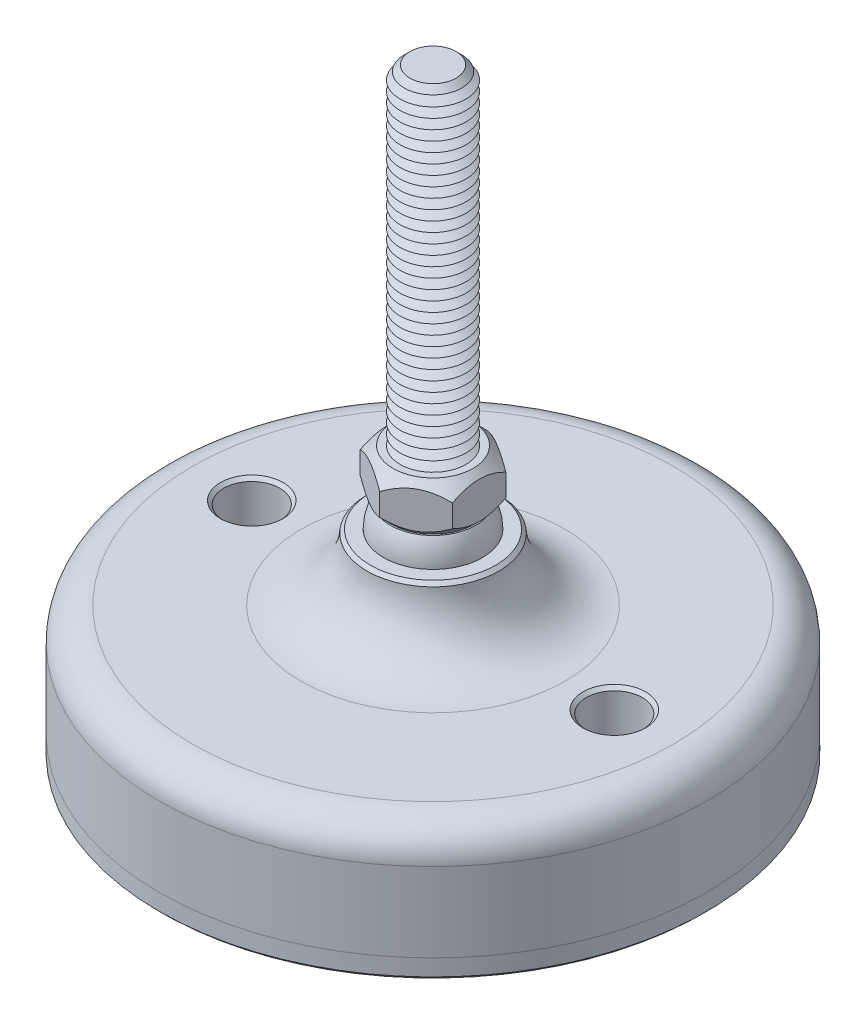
ISO-10303-21;
HEADER;
FILE_DESCRIPTION(('STEP AP214'),'2;1');
FILE_NAME('part.step','',(''),(''),'','','');
FILE_SCHEMA(('AUTOMOTIVE_DESIGN { 1 0 10303 214 1 1 1 1 }'));
ENDSEC;
DATA;
#1=APPLICATION_CONTEXT('core data for automotive mechanical design processes');
#2=APPLICATION_PROTOCOL_DEFINITION('international standard','automotive_design',2000,#1);
#3=PRODUCT_CONTEXT('',#1,'mechanical');
#4=PRODUCT('Part','Part','',(#3));
#5=PRODUCT_RELATED_PRODUCT_CATEGORY('part','',(#4));
#6=PRODUCT_DEFINITION_FORMATION('','',#4);
#7=PRODUCT_DEFINITION_CONTEXT('part definition',#1,'design');
#8=PRODUCT_DEFINITION('design','',#6,#7);
#9=PRODUCT_DEFINITION_SHAPE('','',#8);
#10=(LENGTH_UNIT() NAMED_UNIT(*) SI_UNIT(.MILLI.,.METRE.));
#11=(NAMED_UNIT(*) PLANE_ANGLE_UNIT() SI_UNIT($,.RADIAN.));
#12=(NAMED_UNIT(*) SI_UNIT($,.STERADIAN.) SOLID_ANGLE_UNIT());
#13=UNCERTAINTY_MEASURE_WITH_UNIT(LENGTH_MEASURE(1.E-05),#10,'distance_accuracy_value','');
#14=(GEOMETRIC_REPRESENTATION_CONTEXT(3) GLOBAL_UNCERTAINTY_ASSIGNED_CONTEXT((#13)) GLOBAL_UNIT_ASSIGNED_CONTEXT((#10,
#11,#12)) REPRESENTATION_CONTEXT('',''));
#15=CARTESIAN_POINT('',(0.,0.,0.));
#16=DIRECTION('',(0.,0.,1.));
#17=DIRECTION('',(1.,0.,0.));
#18=AXIS2_PLACEMENT_3D('',#15,#16,#17);
#19=CARTESIAN_POINT('',(0.,-27.,0.));
#20=DIRECTION('',(0.,1.,0.));
#21=DIRECTION('',(0.,0.,1.));
#22=AXIS2_PLACEMENT_3D('',#19,#20,#21);
#23=PLANE('',#22);
#24=CARTESIAN_POINT('',(-27.5,-27.,0.));
#25=DIRECTION('',(0.,1.,0.));
#26=DIRECTION('',(0.,0.,1.));
#27=AXIS2_PLACEMENT_3D('',#24,#25,#26);
#28=CIRCLE('',#27,4.25000000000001);
#29=CARTESIAN_POINT('',(-27.5,-27.,4.25000000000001));
#30=VERTEX_POINT('',#29);
#31=EDGE_CURVE('P0_E43',#30,#30,#28,.T.);
#32=ORIENTED_EDGE('',*,*,#31,.F.);
#33=EDGE_LOOP('',(#32));
#34=FACE_BOUND('',#33,.T.);
#35=CARTESIAN_POINT('',(27.5,-27.,0.));
#36=DIRECTION('',(0.,1.,0.));
#37=DIRECTION('',(0.,0.,1.));
#38=AXIS2_PLACEMENT_3D('',#35,#36,#37);
#39=CIRCLE('',#38,4.25000000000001);
#40=CARTESIAN_POINT('',(27.5,-27.,4.25000000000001));
#41=VERTEX_POINT('',#40);
#42=EDGE_CURVE('P0_E44',#41,#41,#39,.T.);
#43=ORIENTED_EDGE('',*,*,#42,.F.);
#44=EDGE_LOOP('',(#43));
#45=FACE_BOUND('',#44,.T.);
#46=CARTESIAN_POINT('',(0.,-27.,0.));
#47=DIRECTION('',(0.,1.,0.));
#48=DIRECTION('',(0.,0.,1.));
#49=AXIS2_PLACEMENT_3D('',#46,#47,#48);
#50=CIRCLE('',#49,41.5);
#51=CARTESIAN_POINT('',(0.,-27.,41.5));
#52=VERTEX_POINT('',#51);
#53=EDGE_CURVE('P0_E40',#52,#52,#50,.T.);
#54=ORIENTED_EDGE('',*,*,#53,.T.);
#55=EDGE_LOOP('',(#54));
#56=FACE_BOUND('',#55,.T.);
#57=ADVANCED_FACE('P0_F14',(#34,#45,#56),#23,.T.);
#58=CARTESIAN_POINT('',(0.,48.1654938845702,0.));
#59=DIRECTION('',(0.,1.,0.));
#60=DIRECTION('',(0.,0.,1.));
#61=AXIS2_PLACEMENT_3D('',#58,#59,#60);
#62=CYLINDRICAL_SURFACE('',#61,41.5);
#63=CARTESIAN_POINT('',(0.,-29.5,0.));
#64=DIRECTION('',(0.,-1.,0.));
#65=DIRECTION('',(0.,0.,-1.));
#66=AXIS2_PLACEMENT_3D('',#63,#64,#65);
#67=CIRCLE('',#66,41.5);
#68=CARTESIAN_POINT('',(0.,-29.5,-41.5));
#69=VERTEX_POINT('',#68);
#70=EDGE_CURVE('P0_E37',#69,#69,#67,.F.);
#71=ORIENTED_EDGE('',*,*,#70,.T.);
#72=EDGE_LOOP('',(#71));
#73=FACE_BOUND('',#72,.T.);
#74=ORIENTED_EDGE('',*,*,#53,.F.);
#75=EDGE_LOOP('',(#74));
#76=FACE_BOUND('',#75,.T.);
#77=ADVANCED_FACE('P0_F54',(#73,#76),#62,.T.);
#78=CARTESIAN_POINT('',(0.,-30.,41.5));
#79=DIRECTION('',(0.,-1.,0.));
#80=DIRECTION('',(0.,0.,-1.));
#81=AXIS2_PLACEMENT_3D('',#78,#79,#80);
#82=PLANE('',#81);
#83=CARTESIAN_POINT('',(27.5,-30.,0.));
#84=DIRECTION('',(0.,-1.,0.));
#85=DIRECTION('',(0.,0.,-1.));
#86=AXIS2_PLACEMENT_3D('',#83,#84,#85);
#87=CIRCLE('',#86,4.75);
#88=CARTESIAN_POINT('',(27.5,-30.,-4.75000000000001));
#89=VERTEX_POINT('',#88);
#90=EDGE_CURVE('P0_E25',#89,#89,#87,.F.);
#91=ORIENTED_EDGE('',*,*,#90,.T.);
#92=EDGE_LOOP('',(#91));
#93=FACE_BOUND('',#92,.T.);
#94=CARTESIAN_POINT('',(-27.5,-30.,0.));
#95=DIRECTION('',(0.,-1.,0.));
#96=DIRECTION('',(0.,0.,-1.));
#97=AXIS2_PLACEMENT_3D('',#94,#95,#96);
#98=CIRCLE('',#97,4.75);
#99=CARTESIAN_POINT('',(-27.5,-30.,-4.75));
#100=VERTEX_POINT('',#99);
#101=EDGE_CURVE('P0_E29',#100,#100,#98,.F.);
#102=ORIENTED_EDGE('',*,*,#101,.T.);
#103=EDGE_LOOP('',(#102));
#104=FACE_BOUND('',#103,.T.);
#105=CARTESIAN_POINT('',(0.,-30.,0.));
#106=DIRECTION('',(0.,-1.,0.));
#107=DIRECTION('',(0.,0.,-1.));
#108=AXIS2_PLACEMENT_3D('',#105,#106,#107);
#109=CIRCLE('',#108,41.);
#110=CARTESIAN_POINT('',(0.,-30.,-41.));
#111=VERTEX_POINT('',#110);
#112=EDGE_CURVE('P0_E34',#111,#111,#109,.T.);
#113=ORIENTED_EDGE('',*,*,#112,.T.);
#114=EDGE_LOOP('',(#113));
#115=FACE_BOUND('',#114,.T.);
#116=ADVANCED_FACE('P0_F61',(#93,#104,#115),#82,.T.);
#117=CARTESIAN_POINT('',(0.,-29.5,0.));
#118=DIRECTION('',(0.,1.,0.));
#119=DIRECTION('',(0.,0.,1.));
#120=AXIS2_PLACEMENT_3D('',#117,#118,#119);
#121=CONICAL_SURFACE('',#120,41.5,0.785398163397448);
#122=ORIENTED_EDGE('',*,*,#112,.F.);
#123=EDGE_LOOP('',(#122));
#124=FACE_BOUND('',#123,.T.);
#125=ORIENTED_EDGE('',*,*,#70,.F.);
#126=EDGE_LOOP('',(#125));
#127=FACE_BOUND('',#126,.T.);
#128=ADVANCED_FACE('P0_F68',(#124,#127),#121,.T.);
#129=CARTESIAN_POINT('',(27.5,-30.,0.));
#130=DIRECTION('',(0.,1.,0.));
#131=DIRECTION('',(0.,0.,1.));
#132=AXIS2_PLACEMENT_3D('',#129,#130,#131);
#133=CYLINDRICAL_SURFACE('',#132,4.25000000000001);
#134=CARTESIAN_POINT('',(27.5,-29.5,0.));
#135=DIRECTION('',(0.,-1.,0.));
#136=DIRECTION('',(0.,0.,-1.));
#137=AXIS2_PLACEMENT_3D('',#134,#135,#136);
#138=CIRCLE('',#137,4.25000000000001);
#139=CARTESIAN_POINT('',(27.5,-29.5,-4.25000000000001));
#140=VERTEX_POINT('',#139);
#141=EDGE_CURVE('P0_E21',#140,#140,#138,.T.);
#142=ORIENTED_EDGE('',*,*,#141,.T.);
#143=EDGE_LOOP('',(#142));
#144=FACE_BOUND('',#143,.T.);
#145=ORIENTED_EDGE('',*,*,#42,.T.);
#146=EDGE_LOOP('',(#145));
#147=FACE_BOUND('',#146,.T.);
#148=ADVANCED_FACE('P0_F74',(#144,#147),#133,.F.);
#149=CARTESIAN_POINT('',(-27.5,-30.,0.));
#150=DIRECTION('',(0.,1.,0.));
#151=DIRECTION('',(0.,0.,1.));
#152=AXIS2_PLACEMENT_3D('',#149,#150,#151);
#153=CYLINDRICAL_SURFACE('',#152,4.25000000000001);
#154=CARTESIAN_POINT('',(-27.5,-29.5,0.));
#155=DIRECTION('',(0.,-1.,0.));
#156=DIRECTION('',(0.,0.,-1.));
#157=AXIS2_PLACEMENT_3D('',#154,#155,#156);
#158=CIRCLE('',#157,4.25000000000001);
#159=CARTESIAN_POINT('',(-27.5,-29.5,-4.25000000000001));
#160=VERTEX_POINT('',#159);
#161=EDGE_CURVE('P0_E10',#160,#160,#158,.T.);
#162=ORIENTED_EDGE('',*,*,#161,.T.);
#163=EDGE_LOOP('',(#162));
#164=FACE_BOUND('',#163,.T.);
#165=ORIENTED_EDGE('',*,*,#31,.T.);
#166=EDGE_LOOP('',(#165));
#167=FACE_BOUND('',#166,.T.);
#168=ADVANCED_FACE('P0_F50',(#164,#167),#153,.F.);
#169=CARTESIAN_POINT('',(27.5,-30.,0.));
#170=DIRECTION('',(0.,-1.,0.));
#171=DIRECTION('',(0.,0.,-1.));
#172=AXIS2_PLACEMENT_3D('',#169,#170,#171);
#173=CONICAL_SURFACE('',#172,4.75,0.785398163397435);
#174=ORIENTED_EDGE('',*,*,#141,.F.);
#175=EDGE_LOOP('',(#174));
#176=FACE_BOUND('',#175,.T.);
#177=ORIENTED_EDGE('',*,*,#90,.F.);
#178=EDGE_LOOP('',(#177));
#179=FACE_BOUND('',#178,.T.);
#180=ADVANCED_FACE('P0_F76',(#176,#179),#173,.F.);
#181=CARTESIAN_POINT('',(-27.5,-30.,0.));
#182=DIRECTION('',(0.,-1.,0.));
#183=DIRECTION('',(0.,0.,-1.));
#184=AXIS2_PLACEMENT_3D('',#181,#182,#183);
#185=CONICAL_SURFACE('',#184,4.75,0.785398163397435);
#186=ORIENTED_EDGE('',*,*,#161,.F.);
#187=EDGE_LOOP('',(#186));
#188=FACE_BOUND('',#187,.T.);
#189=ORIENTED_EDGE('',*,*,#101,.F.);
#190=EDGE_LOOP('',(#189));
#191=FACE_BOUND('',#190,.T.);
#192=ADVANCED_FACE('P0_F16',(#188,#191),#185,.F.);
#193=CLOSED_SHELL('',(#57,#77,#116,#128,#148,#168,#180,#192));
#194=MANIFOLD_SOLID_BREP('P0_B1',#193);
#195=CARTESIAN_POINT('',(0.,0.,0.));
#196=DIRECTION('',(0.,1.,0.));
#197=DIRECTION('',(0.,0.,-1.));
#198=AXIS2_PLACEMENT_3D('',#195,#196,#197);
#199=SPHERICAL_SURFACE('',#198,7.5);
#200=CARTESIAN_POINT('',(0.,3.75,0.));
#201=DIRECTION('',(0.,-1.,0.));
#202=DIRECTION('',(0.,0.,-1.));
#203=AXIS2_PLACEMENT_3D('',#200,#201,#202);
#204=CIRCLE('',#203,6.49519052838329);
#205=CARTESIAN_POINT('',(0.,3.75,-6.49519052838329));
#206=VERTEX_POINT('',#205);
#207=EDGE_CURVE('P1_E211',#206,#206,#204,.F.);
#208=ORIENTED_EDGE('',*,*,#207,.F.);
#209=EDGE_LOOP('',(#208));
#210=FACE_BOUND('',#209,.T.);
#211=ADVANCED_FACE('P1_F16',(#210),#199,.T.);
#212=CARTESIAN_POINT('',(0.,3.75,0.));
#213=DIRECTION('',(0.,1.,0.));
#214=DIRECTION('',(0.,0.,1.));
#215=AXIS2_PLACEMENT_3D('',#212,#213,#214);
#216=CONICAL_SURFACE('',#215,6.26419292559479,0.785398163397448);
#217=CARTESIAN_POINT('',(0.,3.75,0.));
#218=DIRECTION('',(0.,1.,0.));
#219=DIRECTION('',(0.,0.,1.));
#220=AXIS2_PLACEMENT_3D('',#217,#218,#219);
#221=CIRCLE('',#220,6.26419292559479);
#222=CARTESIAN_POINT('',(0.,3.75,6.26419292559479));
#223=VERTEX_POINT('',#222);
#224=EDGE_CURVE('P1_E215',#223,#223,#221,.T.);
#225=ORIENTED_EDGE('',*,*,#224,.T.);
#226=EDGE_LOOP('',(#225));
#227=FACE_BOUND('',#226,.T.);
#228=CARTESIAN_POINT('',(-7.,8.22175145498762,-8.1400553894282));
#229=CARTESIAN_POINT('',(-7.,8.07177748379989,-7.94220937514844));
#230=CARTESIAN_POINT('',(-7.,7.92322959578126,-7.74326459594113));
#231=CARTESIAN_POINT('',(-7.,7.62962733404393,-7.34274065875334));
#232=CARTESIAN_POINT('',(-7.,7.48457383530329,-7.14116086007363));
#233=CARTESIAN_POINT('',(-7.,7.19756981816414,-6.73345531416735));
#234=CARTESIAN_POINT('',(-7.,7.05565202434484,-6.52730645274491));
#235=CARTESIAN_POINT('',(-7.,6.77703382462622,-6.11152362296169));
#236=CARTESIAN_POINT('',(-7.,6.64033305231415,-5.90188990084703));
#237=CARTESIAN_POINT('',(-7.,6.36550740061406,-5.46619755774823));
#238=CARTESIAN_POINT('',(-7.,6.22776674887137,-5.23989534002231));
#239=CARTESIAN_POINT('',(-7.,5.96123372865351,-4.78200028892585));
#240=CARTESIAN_POINT('',(-7.,5.83244279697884,-4.55040661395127));
#241=CARTESIAN_POINT('',(-7.,5.58658047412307,-4.08193183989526));
#242=CARTESIAN_POINT('',(-7.,5.46947462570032,-3.8450689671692));
#243=CARTESIAN_POINT('',(-7.,5.24960465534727,-3.36483104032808));
#244=CARTESIAN_POINT('',(-7.,5.14683397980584,-3.12145902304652));
#245=CARTESIAN_POINT('',(-7.,4.96723655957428,-2.64866791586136));
#246=CARTESIAN_POINT('',(-7.,4.88895097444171,-2.41980876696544));
#247=CARTESIAN_POINT('',(-7.,4.75072959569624,-1.9565107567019));
#248=CARTESIAN_POINT('',(-7.,4.69079504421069,-1.72207151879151));
#249=CARTESIAN_POINT('',(-7.,4.59342684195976,-1.25295119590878));
#250=CARTESIAN_POINT('',(-7.,4.5556027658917,-1.01835249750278));
#251=CARTESIAN_POINT('',(-7.,4.50320231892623,-0.546559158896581));
#252=CARTESIAN_POINT('',(-7.,4.48862178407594,-0.309364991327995));
#253=CARTESIAN_POINT('',(-7.,4.48382612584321,0.156313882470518));
#254=CARTESIAN_POINT('',(-7.,4.49271264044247,0.384789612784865));
#255=CARTESIAN_POINT('',(-7.,4.53235928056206,0.839822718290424));
#256=CARTESIAN_POINT('',(-7.,4.56312150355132,1.06637990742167));
#257=CARTESIAN_POINT('',(-7.,4.64535130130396,1.51976805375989));
#258=CARTESIAN_POINT('',(-7.,4.69717402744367,1.74653354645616));
#259=CARTESIAN_POINT('',(-7.,4.81873728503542,2.19511331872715));
#260=CARTESIAN_POINT('',(-7.,4.88847641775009,2.41692798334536));
#261=CARTESIAN_POINT('',(-7.,5.04951755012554,2.87389766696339));
#262=CARTESIAN_POINT('',(-7.,5.14215063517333,3.10857869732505));
#263=CARTESIAN_POINT('',(-7.,5.3416605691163,3.57185972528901));
#264=CARTESIAN_POINT('',(-7.,5.44854400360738,3.80045685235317));
#265=CARTESIAN_POINT('',(-7.,5.6740138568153,4.25267813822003));
#266=CARTESIAN_POINT('',(-7.,5.79263686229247,4.47628390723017));
#267=CARTESIAN_POINT('',(-7.,6.03896666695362,4.91835509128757));
#268=CARTESIAN_POINT('',(-7.,6.16667203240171,5.13682131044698));
#269=CARTESIAN_POINT('',(-7.,6.4228595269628,5.55855563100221));
#270=CARTESIAN_POINT('',(-7.,6.55098806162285,5.76203966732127));
#271=CARTESIAN_POINT('',(-7.,6.81264959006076,6.16551366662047));
#272=CARTESIAN_POINT('',(-7.,6.94618299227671,6.36550336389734));
#273=CARTESIAN_POINT('',(-7.,7.21658951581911,6.76082742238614));
#274=CARTESIAN_POINT('',(-7.,7.35342681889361,6.95618637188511));
#275=CARTESIAN_POINT('',(-7.,7.6307324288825,7.34423185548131));
#276=CARTESIAN_POINT('',(-7.,7.77119972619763,7.53691911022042));
#277=CARTESIAN_POINT('',(-7.,7.91315155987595,7.72848711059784));
#278=B_SPLINE_CURVE_WITH_KNOTS('',3,(#228,#229,#230,#231,#232,#233,#234,#235,#236,#237,#238,
#239,#240,#241,#242,#243,#244,#245,#246,#247,#248,#249,#250,#251,#252,#253,#254,#255,#256,#257,
#258,#259,#260,#261,#262,#263,#264,#265,#266,#267,#268,#269,#270,#271,#272,#273,#274,#275,#276,
#277),.UNSPECIFIED.,.F.,.F.,(4,2,2,2,2,2,2,2,2,2,2,2,2,2,2,2,2,2,2,2,2,2,2,2,4),(0.,
0.744807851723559,1.48980030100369,2.2405614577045,2.99126978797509,3.78587980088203,
4.58061708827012,5.37293691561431,6.16489332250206,6.88989369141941,7.61494312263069,
8.32676947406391,9.0384682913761,9.72332048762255,10.4082383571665,11.1052200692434,
11.8021473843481,12.5584650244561,13.3151334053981,14.0742390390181,14.8332251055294,
15.5545151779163,16.2758598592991,16.9913609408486,17.7066651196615),.UNSPECIFIED.);
#279=CARTESIAN_POINT('',(-7.,5.56871084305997,-4.04145188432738));
#280=VERTEX_POINT('',#279);
#281=CARTESIAN_POINT('',(-7.,5.56871084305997,4.04145188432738));
#282=VERTEX_POINT('',#281);
#283=EDGE_CURVE('P1_E25',#280,#282,#278,.T.);
#284=ORIENTED_EDGE('',*,*,#283,.F.);
#285=CARTESIAN_POINT('',(0.000199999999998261,5.56882631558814,-8.0830192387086));
#286=CARTESIAN_POINT('',(-0.120159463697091,5.49934419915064,-8.01352966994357));
#287=CARTESIAN_POINT('',(-0.241444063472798,5.43199440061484,-7.94350597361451));
#288=CARTESIAN_POINT('',(-0.486045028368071,5.30220807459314,-7.80228554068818));
#289=CARTESIAN_POINT('',(-0.60936245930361,5.2397742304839,-7.73108818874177));
#290=CARTESIAN_POINT('',(-0.983781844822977,5.06028719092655,-7.51491705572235));
#291=CARTESIAN_POINT('',(-1.23805341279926,4.95181416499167,-7.36811329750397));
#292=CARTESIAN_POINT('',(-1.75081233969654,4.76606165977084,-7.07207179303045));
#293=CARTESIAN_POINT('',(-2.00916864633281,4.68831421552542,-6.92290970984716));
#294=CARTESIAN_POINT('',(-2.40095049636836,4.59837958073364,-6.69671435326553));
#295=CARTESIAN_POINT('',(-2.53212124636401,4.57286115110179,-6.62098288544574));
#296=CARTESIAN_POINT('',(-2.79557335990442,4.53129725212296,-6.4688787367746));
#297=CARTESIAN_POINT('',(-2.92785455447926,4.5152503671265,-6.39250615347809));
#298=CARTESIAN_POINT('',(-3.25020698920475,4.48834537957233,-6.2063958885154));
#299=CARTESIAN_POINT('',(-3.44062555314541,4.48270029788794,-6.09645767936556));
#300=CARTESIAN_POINT('',(-3.82111946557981,4.49217587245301,-5.87677941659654));
#301=CARTESIAN_POINT('',(-4.01119467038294,4.5073038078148,-5.76703944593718));
#302=CARTESIAN_POINT('',(-4.38955306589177,4.55743368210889,-5.54859412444));
#303=CARTESIAN_POINT('',(-4.57783401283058,4.5924578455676,-5.43989006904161));
#304=CARTESIAN_POINT('',(-4.95115981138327,4.68047604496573,-5.22435031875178));
#305=CARTESIAN_POINT('',(-5.13620490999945,4.73346870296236,-5.1175144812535));
#306=CARTESIAN_POINT('',(-5.46469033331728,4.84248989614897,-4.92786333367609));
#307=CARTESIAN_POINT('',(-5.6088580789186,4.89565100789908,-4.8446280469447));
#308=CARTESIAN_POINT('',(-5.8946056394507,5.0105398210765,-4.67965161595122));
#309=CARTESIAN_POINT('',(-6.03618537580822,5.07226778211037,-4.5979105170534));
#310=CARTESIAN_POINT('',(-6.31631098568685,5.20290661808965,-4.43617992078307));
#311=CARTESIAN_POINT('',(-6.4548648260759,5.27179490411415,-4.3561858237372));
#312=CARTESIAN_POINT('',(-6.72940692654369,5.41585000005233,-4.19767886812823));
#313=CARTESIAN_POINT('',(-6.86539669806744,5.49101295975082,-4.11916513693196));
#314=CARTESIAN_POINT('',(-7.0002,5.56882631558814,-4.04133641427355));
#315=B_SPLINE_CURVE_WITH_KNOTS('',3,(#285,#286,#287,#288,#289,#290,#291,#292,#293,#294,#295,
#296,#297,#298,#299,#300,#301,#302,#303,#304,#305,#306,#307,#308,#309,#310,#311,#312,#313,#314),
.UNSPECIFIED.,.F.,.F.,(4,2,2,2,2,2,2,2,2,2,2,2,2,2,4),(0.,0.466112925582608,0.932478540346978,
1.87024464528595,2.79312018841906,3.25365289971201,3.71411676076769,4.37293813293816,
5.03199042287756,5.69178034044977,6.35151967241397,6.8755322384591,7.39956068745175,
7.92198344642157,8.44408796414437),.UNSPECIFIED.);
#316=CARTESIAN_POINT('',(0.,5.56871084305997,-8.08290376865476));
#317=VERTEX_POINT('',#316);
#318=EDGE_CURVE('P1_E116',#317,#280,#315,.T.);
#319=ORIENTED_EDGE('',*,*,#318,.F.);
#320=CARTESIAN_POINT('',(7.00019999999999,5.56882631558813,-4.04133641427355));
#321=CARTESIAN_POINT('',(6.8798405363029,5.49934419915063,-4.11082598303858));
#322=CARTESIAN_POINT('',(6.7585559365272,5.43199440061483,-4.18084967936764));
#323=CARTESIAN_POINT('',(6.51395497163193,5.30220807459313,-4.32207011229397));
#324=CARTESIAN_POINT('',(6.39063754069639,5.2397742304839,-4.39326746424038));
#325=CARTESIAN_POINT('',(6.01621815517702,5.06028719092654,-4.6094385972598));
#326=CARTESIAN_POINT('',(5.76194658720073,4.95181416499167,-4.75624235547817));
#327=CARTESIAN_POINT('',(5.24918766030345,4.76606165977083,-5.0522838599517));
#328=CARTESIAN_POINT('',(4.99083135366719,4.68831421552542,-5.20144594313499));
#329=CARTESIAN_POINT('',(4.59904950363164,4.59837958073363,-5.42764129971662));
#330=CARTESIAN_POINT('',(4.46787875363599,4.57286115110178,-5.50337276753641));
#331=CARTESIAN_POINT('',(4.20442664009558,4.53129725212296,-5.65547691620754));
#332=CARTESIAN_POINT('',(4.07214544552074,4.5152503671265,-5.73184949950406));
#333=CARTESIAN_POINT('',(3.74979301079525,4.48834537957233,-5.91795976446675));
#334=CARTESIAN_POINT('',(3.55937444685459,4.48270029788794,-6.02789797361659));
#335=CARTESIAN_POINT('',(3.17888053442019,4.49217587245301,-6.2475762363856));
#336=CARTESIAN_POINT('',(2.98880532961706,4.5073038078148,-6.35731620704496));
#337=CARTESIAN_POINT('',(2.61044693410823,4.55743368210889,-6.57576152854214));
#338=CARTESIAN_POINT('',(2.42216598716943,4.5924578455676,-6.68446558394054));
#339=CARTESIAN_POINT('',(2.04884018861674,4.68047604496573,-6.90000533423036));
#340=CARTESIAN_POINT('',(1.86379509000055,4.73346870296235,-7.00684117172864));
#341=CARTESIAN_POINT('',(1.53530966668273,4.84248989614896,-7.19649231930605));
#342=CARTESIAN_POINT('',(1.3911419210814,4.89565100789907,-7.27972760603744));
#343=CARTESIAN_POINT('',(1.1053943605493,5.0105398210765,-7.44470403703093));
#344=CARTESIAN_POINT('',(0.96381462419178,5.07226778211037,-7.52644513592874));
#345=CARTESIAN_POINT('',(0.683689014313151,5.20290661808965,-7.68817573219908));
#346=CARTESIAN_POINT('',(0.545135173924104,5.27179490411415,-7.76816982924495));
#347=CARTESIAN_POINT('',(0.270593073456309,5.41585000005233,-7.92667678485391));
#348=CARTESIAN_POINT('',(0.134603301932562,5.49101295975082,-8.00519051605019));
#349=CARTESIAN_POINT('',(-0.00020000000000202,5.56882631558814,-8.0830192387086));
#350=B_SPLINE_CURVE_WITH_KNOTS('',3,(#320,#321,#322,#323,#324,#325,#326,#327,#328,#329,#330,
#331,#332,#333,#334,#335,#336,#337,#338,#339,#340,#341,#342,#343,#344,#345,#346,#347,#348,#349),
.UNSPECIFIED.,.F.,.F.,(4,2,2,2,2,2,2,2,2,2,2,2,2,2,4),(0.,0.466112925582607,0.932478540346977,
1.87024464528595,2.79312018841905,3.25365289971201,3.71411676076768,4.37293813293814,
5.03199042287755,5.69178034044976,6.35151967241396,6.87553223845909,7.39956068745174,
7.92198344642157,8.44408796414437),.UNSPECIFIED.);
#351=CARTESIAN_POINT('',(7.,5.56871084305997,-4.04145188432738));
#352=VERTEX_POINT('',#351);
#353=EDGE_CURVE('P1_E123',#352,#317,#350,.T.);
#354=ORIENTED_EDGE('',*,*,#353,.F.);
#355=CARTESIAN_POINT('',(6.99999999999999,8.22175145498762,-8.1400553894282));
#356=CARTESIAN_POINT('',(6.99999999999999,8.07177748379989,-7.94220937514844));
#357=CARTESIAN_POINT('',(6.99999999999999,7.92322959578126,-7.74326459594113));
#358=CARTESIAN_POINT('',(6.99999999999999,7.62962733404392,-7.34274065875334));
#359=CARTESIAN_POINT('',(6.99999999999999,7.48457383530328,-7.14116086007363));
#360=CARTESIAN_POINT('',(6.99999999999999,7.19756981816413,-6.73345531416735));
#361=CARTESIAN_POINT('',(6.99999999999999,7.05565202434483,-6.52730645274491));
#362=CARTESIAN_POINT('',(6.99999999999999,6.77703382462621,-6.11152362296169));
#363=CARTESIAN_POINT('',(6.99999999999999,6.64033305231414,-5.90188990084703));
#364=CARTESIAN_POINT('',(6.99999999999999,6.36550740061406,-5.46619755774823));
#365=CARTESIAN_POINT('',(6.99999999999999,6.22776674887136,-5.23989534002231));
#366=CARTESIAN_POINT('',(6.99999999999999,5.9612337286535,-4.78200028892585));
#367=CARTESIAN_POINT('',(6.99999999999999,5.83244279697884,-4.55040661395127));
#368=CARTESIAN_POINT('',(6.99999999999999,5.58658047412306,-4.08193183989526));
#369=CARTESIAN_POINT('',(6.99999999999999,5.46947462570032,-3.8450689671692));
#370=CARTESIAN_POINT('',(6.99999999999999,5.24960465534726,-3.36483104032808));
#371=CARTESIAN_POINT('',(6.99999999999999,5.14683397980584,-3.12145902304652));
#372=CARTESIAN_POINT('',(6.99999999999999,4.96723655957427,-2.64866791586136));
#373=CARTESIAN_POINT('',(6.99999999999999,4.88895097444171,-2.41980876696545));
#374=CARTESIAN_POINT('',(6.99999999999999,4.75072959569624,-1.9565107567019));
#375=CARTESIAN_POINT('',(6.99999999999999,4.69079504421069,-1.72207151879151));
#376=CARTESIAN_POINT('',(6.99999999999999,4.59342684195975,-1.25295119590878));
#377=CARTESIAN_POINT('',(6.99999999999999,4.5556027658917,-1.01835249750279));
#378=CARTESIAN_POINT('',(6.99999999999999,4.50320231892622,-0.546559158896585));
#379=CARTESIAN_POINT('',(6.99999999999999,4.48862178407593,-0.309364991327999));
#380=CARTESIAN_POINT('',(6.99999999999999,4.48382612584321,0.156313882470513));
#381=CARTESIAN_POINT('',(6.99999999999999,4.49271264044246,0.38478961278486));
#382=CARTESIAN_POINT('',(6.99999999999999,4.53235928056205,0.83982271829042));
#383=CARTESIAN_POINT('',(6.99999999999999,4.56312150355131,1.06637990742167));
#384=CARTESIAN_POINT('',(6.99999999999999,4.64535130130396,1.51976805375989));
#385=CARTESIAN_POINT('',(6.99999999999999,4.69717402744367,1.74653354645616));
#386=CARTESIAN_POINT('',(6.99999999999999,4.81873728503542,2.19511331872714));
#387=CARTESIAN_POINT('',(7.,4.88847641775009,2.41692798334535));
#388=CARTESIAN_POINT('',(7.,5.04951755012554,2.87389766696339));
#389=CARTESIAN_POINT('',(7.,5.14215063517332,3.10857869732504));
#390=CARTESIAN_POINT('',(7.,5.34166056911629,3.571859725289));
#391=CARTESIAN_POINT('',(7.,5.44854400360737,3.80045685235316));
#392=CARTESIAN_POINT('',(7.,5.67401385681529,4.25267813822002));
#393=CARTESIAN_POINT('',(7.,5.79263686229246,4.47628390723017));
#394=CARTESIAN_POINT('',(7.,6.03896666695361,4.91835509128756));
#395=CARTESIAN_POINT('',(7.,6.1666720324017,5.13682131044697));
#396=CARTESIAN_POINT('',(7.,6.42285952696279,5.5585556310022));
#397=CARTESIAN_POINT('',(7.,6.55098806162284,5.76203966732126));
#398=CARTESIAN_POINT('',(7.,6.81264959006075,6.16551366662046));
#399=CARTESIAN_POINT('',(7.,6.9461829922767,6.36550336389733));
#400=CARTESIAN_POINT('',(7.,7.21658951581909,6.76082742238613));
#401=CARTESIAN_POINT('',(7.,7.3534268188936,6.9561863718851));
#402=CARTESIAN_POINT('',(7.,7.63073242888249,7.3442318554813));
#403=CARTESIAN_POINT('',(7.,7.77119972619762,7.53691911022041));
#404=CARTESIAN_POINT('',(7.,7.91315155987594,7.72848711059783));
#405=B_SPLINE_CURVE_WITH_KNOTS('',3,(#355,#356,#357,#358,#359,#360,#361,#362,#363,#364,#365,
#366,#367,#368,#369,#370,#371,#372,#373,#374,#375,#376,#377,#378,#379,#380,#381,#382,#383,#384,
#385,#386,#387,#388,#389,#390,#391,#392,#393,#394,#395,#396,#397,#398,#399,#400,#401,#402,#403,
#404),.UNSPECIFIED.,.F.,.F.,(4,2,2,2,2,2,2,2,2,2,2,2,2,2,2,2,2,2,2,2,2,2,2,2,4),(0.,
0.744807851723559,1.48980030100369,2.2405614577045,2.9912697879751,3.78587980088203,
4.58061708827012,5.3729369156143,6.16489332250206,6.8898936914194,7.61494312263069,
8.32676947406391,9.03846829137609,9.72332048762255,10.4082383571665,11.1052200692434,
11.8021473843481,12.5584650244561,13.3151334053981,14.0742390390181,14.8332251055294,
15.5545151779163,16.275859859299,16.9913609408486,17.7066651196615),.UNSPECIFIED.);
#406=CARTESIAN_POINT('',(6.99999999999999,5.56871084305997,4.04145188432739));
#407=VERTEX_POINT('',#406);
#408=EDGE_CURVE('P1_E71',#407,#352,#405,.F.);
#409=ORIENTED_EDGE('',*,*,#408,.F.);
#410=CARTESIAN_POINT('',(-0.000200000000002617,5.56882631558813,8.0830192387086));
#411=CARTESIAN_POINT('',(0.120159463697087,5.49934419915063,8.01352966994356));
#412=CARTESIAN_POINT('',(0.241444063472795,5.43199440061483,7.9435059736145));
#413=CARTESIAN_POINT('',(0.486045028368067,5.30220807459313,7.80228554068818));
#414=CARTESIAN_POINT('',(0.609362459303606,5.2397742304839,7.73108818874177));
#415=CARTESIAN_POINT('',(0.983781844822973,5.06028719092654,7.51491705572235));
#416=CARTESIAN_POINT('',(1.23805341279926,4.95181416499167,7.36811329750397));
#417=CARTESIAN_POINT('',(1.75081233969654,4.76606165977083,7.07207179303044));
#418=CARTESIAN_POINT('',(2.00916864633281,4.68831421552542,6.92290970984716));
#419=CARTESIAN_POINT('',(2.40095049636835,4.59837958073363,6.69671435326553));
#420=CARTESIAN_POINT('',(2.53212124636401,4.57286115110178,6.62098288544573));
#421=CARTESIAN_POINT('',(2.79557335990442,4.53129725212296,6.4688787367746));
#422=CARTESIAN_POINT('',(2.92785455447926,4.5152503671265,6.39250615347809));
#423=CARTESIAN_POINT('',(3.25020698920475,4.48834537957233,6.2063958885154));
#424=CARTESIAN_POINT('',(3.44062555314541,4.48270029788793,6.09645767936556));
#425=CARTESIAN_POINT('',(3.82111946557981,4.492175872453,5.87677941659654));
#426=CARTESIAN_POINT('',(4.01119467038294,4.5073038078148,5.76703944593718));
#427=CARTESIAN_POINT('',(4.38955306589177,4.55743368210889,5.54859412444));
#428=CARTESIAN_POINT('',(4.57783401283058,4.5924578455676,5.4398900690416));
#429=CARTESIAN_POINT('',(4.95115981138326,4.68047604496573,5.22435031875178));
#430=CARTESIAN_POINT('',(5.13620490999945,4.73346870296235,5.1175144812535));
#431=CARTESIAN_POINT('',(5.46469033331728,4.84248989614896,4.92786333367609));
#432=CARTESIAN_POINT('',(5.6088580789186,4.89565100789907,4.8446280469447));
#433=CARTESIAN_POINT('',(5.8946056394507,5.01053982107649,4.67965161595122));
#434=CARTESIAN_POINT('',(6.03618537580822,5.07226778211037,4.5979105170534));
#435=CARTESIAN_POINT('',(6.31631098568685,5.20290661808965,4.43617992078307));
#436=CARTESIAN_POINT('',(6.45486482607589,5.27179490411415,4.3561858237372));
#437=CARTESIAN_POINT('',(6.72940692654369,5.41585000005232,4.19767886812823));
#438=CARTESIAN_POINT('',(6.86539669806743,5.49101295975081,4.11916513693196));
#439=CARTESIAN_POINT('',(7.00019999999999,5.56882631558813,4.04133641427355));
#440=B_SPLINE_CURVE_WITH_KNOTS('',3,(#410,#411,#412,#413,#414,#415,#416,#417,#418,#419,#420,
#421,#422,#423,#424,#425,#426,#427,#428,#429,#430,#431,#432,#433,#434,#435,#436,#437,#438,#439),
.UNSPECIFIED.,.F.,.F.,(4,2,2,2,2,2,2,2,2,2,2,2,2,2,4),(0.,0.466112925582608,0.932478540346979,
1.87024464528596,2.79312018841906,3.25365289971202,3.71411676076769,4.37293813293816,
5.03199042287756,5.69178034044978,6.35151967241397,6.8755322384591,7.39956068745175,
7.92198344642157,8.44408796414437),.UNSPECIFIED.);
#441=CARTESIAN_POINT('',(0.,5.56871084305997,8.08290376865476));
#442=VERTEX_POINT('',#441);
#443=EDGE_CURVE('P1_E68',#442,#407,#440,.T.);
#444=ORIENTED_EDGE('',*,*,#443,.F.);
#445=CARTESIAN_POINT('',(-7.0002,5.56882631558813,4.04133641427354));
#446=CARTESIAN_POINT('',(-6.87984053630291,5.49934419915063,4.11082598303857));
#447=CARTESIAN_POINT('',(-6.7585559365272,5.43199440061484,4.18084967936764));
#448=CARTESIAN_POINT('',(-6.51395497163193,5.30220807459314,4.32207011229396));
#449=CARTESIAN_POINT('',(-6.39063754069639,5.2397742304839,4.39326746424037));
#450=CARTESIAN_POINT('',(-6.01621815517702,5.06028719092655,4.60943859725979));
#451=CARTESIAN_POINT('',(-5.76194658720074,4.95181416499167,4.75624235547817));
#452=CARTESIAN_POINT('',(-5.24918766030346,4.76606165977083,5.0522838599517));
#453=CARTESIAN_POINT('',(-4.99083135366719,4.68831421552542,5.20144594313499));
#454=CARTESIAN_POINT('',(-4.59904950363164,4.59837958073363,5.42764129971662));
#455=CARTESIAN_POINT('',(-4.46787875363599,4.57286115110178,5.50337276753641));
#456=CARTESIAN_POINT('',(-4.20442664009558,4.53129725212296,5.65547691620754));
#457=CARTESIAN_POINT('',(-4.07214544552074,4.5152503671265,5.73184949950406));
#458=CARTESIAN_POINT('',(-3.74979301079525,4.48834537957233,5.91795976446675));
#459=CARTESIAN_POINT('',(-3.55937444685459,4.48270029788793,6.02789797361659));
#460=CARTESIAN_POINT('',(-3.17888053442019,4.492175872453,6.2475762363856));
#461=CARTESIAN_POINT('',(-2.98880532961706,4.5073038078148,6.35731620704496));
#462=CARTESIAN_POINT('',(-2.61044693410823,4.55743368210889,6.57576152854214));
#463=CARTESIAN_POINT('',(-2.42216598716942,4.5924578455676,6.68446558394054));
#464=CARTESIAN_POINT('',(-2.04884018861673,4.68047604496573,6.90000533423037));
#465=CARTESIAN_POINT('',(-1.86379509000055,4.73346870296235,7.00684117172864));
#466=CARTESIAN_POINT('',(-1.53530966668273,4.84248989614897,7.19649231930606));
#467=CARTESIAN_POINT('',(-1.3911419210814,4.89565100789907,7.27972760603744));
#468=CARTESIAN_POINT('',(-1.1053943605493,5.01053982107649,7.44470403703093));
#469=CARTESIAN_POINT('',(-0.963814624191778,5.07226778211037,7.52644513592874));
#470=CARTESIAN_POINT('',(-0.683689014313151,5.20290661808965,7.68817573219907));
#471=CARTESIAN_POINT('',(-0.545135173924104,5.27179490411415,7.76816982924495));
#472=CARTESIAN_POINT('',(-0.270593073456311,5.41585000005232,7.92667678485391));
#473=CARTESIAN_POINT('',(-0.134603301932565,5.49101295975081,8.00519051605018));
#474=CARTESIAN_POINT('',(0.000199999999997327,5.56882631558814,8.0830192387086));
#475=B_SPLINE_CURVE_WITH_KNOTS('',3,(#445,#446,#447,#448,#449,#450,#451,#452,#453,#454,#455,
#456,#457,#458,#459,#460,#461,#462,#463,#464,#465,#466,#467,#468,#469,#470,#471,#472,#473,#474),
.UNSPECIFIED.,.F.,.F.,(4,2,2,2,2,2,2,2,2,2,2,2,2,2,4),(0.,0.466112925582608,0.93247854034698,
1.87024464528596,2.79312018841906,3.25365289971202,3.71411676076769,4.37293813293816,
5.03199042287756,5.69178034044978,6.35151967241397,6.8755322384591,7.39956068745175,
7.92198344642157,8.44408796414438),.UNSPECIFIED.);
#476=EDGE_CURVE('P1_E40',#282,#442,#475,.T.);
#477=ORIENTED_EDGE('',*,*,#476,.F.);
#478=EDGE_LOOP('',(#284,#319,#354,#409,#444,#477));
#479=FACE_BOUND('',#478,.T.);
#480=ADVANCED_FACE('P1_F69',(#227,#479),#216,.T.);
#481=CARTESIAN_POINT('',(0.,3.75,6.26419292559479));
#482=DIRECTION('',(0.,-1.,0.));
#483=DIRECTION('',(0.,0.,-1.));
#484=AXIS2_PLACEMENT_3D('',#481,#482,#483);
#485=PLANE('',#484);
#486=ORIENTED_EDGE('',*,*,#207,.T.);
#487=EDGE_LOOP('',(#486));
#488=FACE_BOUND('',#487,.T.);
#489=ORIENTED_EDGE('',*,*,#224,.F.);
#490=EDGE_LOOP('',(#489));
#491=FACE_BOUND('',#490,.T.);
#492=ADVANCED_FACE('P1_F107',(#488,#491),#485,.F.);
#493=CARTESIAN_POINT('',(-7.,11.,4.04145188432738));
#494=DIRECTION('',(0.5,0.,-0.866025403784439));
#495=DIRECTION('',(-0.866025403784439,0.,-0.5));
#496=AXIS2_PLACEMENT_3D('',#493,#494,#495);
#497=PLANE('',#496);
#498=DIRECTION('',(0.,-1.,0.));
#499=VECTOR('',#498,1.);
#500=CARTESIAN_POINT('',(0.,11.,8.08290376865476));
#501=LINE('',#500,#499);
#502=CARTESIAN_POINT('',(0.,8.97927405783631,8.08290376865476));
#503=VERTEX_POINT('',#502);
#504=EDGE_CURVE('P1_E82',#503,#442,#501,.T.);
#505=ORIENTED_EDGE('',*,*,#504,.F.);
#506=CARTESIAN_POINT('',(0.000199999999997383,8.97915858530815,8.0830192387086));
#507=CARTESIAN_POINT('',(-0.120159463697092,9.04864070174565,8.01352966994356));
#508=CARTESIAN_POINT('',(-0.241444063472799,9.11599050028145,7.9435059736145));
#509=CARTESIAN_POINT('',(-0.486045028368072,9.24577682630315,7.80228554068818));
#510=CARTESIAN_POINT('',(-0.609362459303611,9.30821067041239,7.73108818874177));
#511=CARTESIAN_POINT('',(-0.983781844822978,9.48769770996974,7.51491705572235));
#512=CARTESIAN_POINT('',(-1.23805341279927,9.59617073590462,7.36811329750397));
#513=CARTESIAN_POINT('',(-1.75081233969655,9.78192324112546,7.07207179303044));
#514=CARTESIAN_POINT('',(-2.00916864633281,9.85967068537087,6.92290970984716));
#515=CARTESIAN_POINT('',(-2.40095049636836,9.94960532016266,6.69671435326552));
#516=CARTESIAN_POINT('',(-2.53212124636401,9.9751237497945,6.62098288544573));
#517=CARTESIAN_POINT('',(-2.79557335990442,10.0166876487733,6.4688787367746));
#518=CARTESIAN_POINT('',(-2.92785455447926,10.0327345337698,6.39250615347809));
#519=CARTESIAN_POINT('',(-3.25020698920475,10.059639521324,6.2063958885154));
#520=CARTESIAN_POINT('',(-3.44062555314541,10.0652846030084,6.09645767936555));
#521=CARTESIAN_POINT('',(-3.82111946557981,10.0558090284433,5.87677941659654));
#522=CARTESIAN_POINT('',(-4.01119467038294,10.0406810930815,5.76703944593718));
#523=CARTESIAN_POINT('',(-4.38955306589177,9.9905512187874,5.54859412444));
#524=CARTESIAN_POINT('',(-4.57783401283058,9.95552705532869,5.4398900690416));
#525=CARTESIAN_POINT('',(-4.95115981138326,9.86750885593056,5.22435031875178));
#526=CARTESIAN_POINT('',(-5.13620490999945,9.81451619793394,5.1175144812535));
#527=CARTESIAN_POINT('',(-5.46469033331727,9.70549500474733,4.92786333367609));
#528=CARTESIAN_POINT('',(-5.6088580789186,9.65233389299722,4.8446280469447));
#529=CARTESIAN_POINT('',(-5.8946056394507,9.5374450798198,4.67965161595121));
#530=CARTESIAN_POINT('',(-6.03618537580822,9.47571711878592,4.5979105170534));
#531=CARTESIAN_POINT('',(-6.31631098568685,9.34507828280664,4.43617992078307));
#532=CARTESIAN_POINT('',(-6.4548648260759,9.27618999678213,4.35618582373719));
#533=CARTESIAN_POINT('',(-6.72940692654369,9.13213490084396,4.19767886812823));
#534=CARTESIAN_POINT('',(-6.86539669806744,9.05697194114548,4.11916513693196));
#535=CARTESIAN_POINT('',(-7.0002,8.97915858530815,4.04133641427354));
#536=B_SPLINE_CURVE_WITH_KNOTS('',3,(#506,#507,#508,#509,#510,#511,#512,#513,#514,#515,#516,
#517,#518,#519,#520,#521,#522,#523,#524,#525,#526,#527,#528,#529,#530,#531,#532,#533,#534,#535),
.UNSPECIFIED.,.F.,.F.,(4,2,2,2,2,2,2,2,2,2,2,2,2,2,4),(0.,0.466112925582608,0.932478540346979,
1.87024464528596,2.79312018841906,3.25365289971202,3.71411676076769,4.37293813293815,
5.03199042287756,5.69178034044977,6.35151967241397,6.87553223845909,7.39956068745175,
7.92198344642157,8.44408796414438),.UNSPECIFIED.);
#537=CARTESIAN_POINT('',(-7.,8.97927405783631,4.04145188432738));
#538=VERTEX_POINT('',#537);
#539=EDGE_CURVE('P1_E153',#503,#538,#536,.T.);
#540=ORIENTED_EDGE('',*,*,#539,.T.);
#541=DIRECTION('',(0.,-1.,0.));
#542=VECTOR('',#541,1.);
#543=CARTESIAN_POINT('',(-7.,11.,4.04145188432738));
#544=LINE('',#543,#542);
#545=EDGE_CURVE('P1_E84',#538,#282,#544,.T.);
#546=ORIENTED_EDGE('',*,*,#545,.T.);
#547=ORIENTED_EDGE('',*,*,#476,.T.);
#548=EDGE_LOOP('',(#505,#540,#546,#547));
#549=FACE_BOUND('',#548,.T.);
#550=ADVANCED_FACE('P1_F80',(#549),#497,.F.);
#551=CARTESIAN_POINT('',(0.,11.,8.08290376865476));
#552=DIRECTION('',(-0.5,0.,-0.866025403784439));
#553=DIRECTION('',(-0.866025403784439,0.,0.5));
#554=AXIS2_PLACEMENT_3D('',#551,#552,#553);
#555=PLANE('',#554);
#556=DIRECTION('',(0.,-1.,0.));
#557=VECTOR('',#556,1.);
#558=CARTESIAN_POINT('',(7.,11.,4.04145188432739));
#559=LINE('',#558,#557);
#560=CARTESIAN_POINT('',(7.,8.97927405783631,4.04145188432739));
#561=VERTEX_POINT('',#560);
#562=EDGE_CURVE('P1_E89',#561,#407,#559,.T.);
#563=ORIENTED_EDGE('',*,*,#562,.F.);
#564=CARTESIAN_POINT('',(7.0002,8.97915858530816,4.04133641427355));
#565=CARTESIAN_POINT('',(6.87984053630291,9.04864070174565,4.11082598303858));
#566=CARTESIAN_POINT('',(6.7585559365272,9.11599050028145,4.18084967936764));
#567=CARTESIAN_POINT('',(6.51395497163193,9.24577682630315,4.32207011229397));
#568=CARTESIAN_POINT('',(6.39063754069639,9.30821067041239,4.39326746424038));
#569=CARTESIAN_POINT('',(6.01621815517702,9.48769770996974,4.6094385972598));
#570=CARTESIAN_POINT('',(5.76194658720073,9.59617073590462,4.75624235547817));
#571=CARTESIAN_POINT('',(5.24918766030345,9.78192324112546,5.0522838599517));
#572=CARTESIAN_POINT('',(4.99083135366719,9.85967068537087,5.20144594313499));
#573=CARTESIAN_POINT('',(4.59904950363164,9.94960532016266,5.42764129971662));
#574=CARTESIAN_POINT('',(4.46787875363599,9.9751237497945,5.50337276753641));
#575=CARTESIAN_POINT('',(4.20442664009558,10.0166876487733,5.65547691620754));
#576=CARTESIAN_POINT('',(4.07214544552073,10.0327345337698,5.73184949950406));
#577=CARTESIAN_POINT('',(3.74979301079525,10.059639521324,5.91795976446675));
#578=CARTESIAN_POINT('',(3.55937444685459,10.0652846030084,6.02789797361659));
#579=CARTESIAN_POINT('',(3.17888053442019,10.0558090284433,6.2475762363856));
#580=CARTESIAN_POINT('',(2.98880532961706,10.0406810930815,6.35731620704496));
#581=CARTESIAN_POINT('',(2.61044693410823,9.9905512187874,6.57576152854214));
#582=CARTESIAN_POINT('',(2.42216598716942,9.95552705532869,6.68446558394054));
#583=CARTESIAN_POINT('',(2.04884018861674,9.86750885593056,6.90000533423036));
#584=CARTESIAN_POINT('',(1.86379509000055,9.81451619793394,7.00684117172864));
#585=CARTESIAN_POINT('',(1.53530966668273,9.70549500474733,7.19649231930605));
#586=CARTESIAN_POINT('',(1.3911419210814,9.65233389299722,7.27972760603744));
#587=CARTESIAN_POINT('',(1.1053943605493,9.5374450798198,7.44470403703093));
#588=CARTESIAN_POINT('',(0.963814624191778,9.47571711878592,7.52644513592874));
#589=CARTESIAN_POINT('',(0.683689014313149,9.34507828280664,7.68817573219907));
#590=CARTESIAN_POINT('',(0.545135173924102,9.27618999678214,7.76816982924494));
#591=CARTESIAN_POINT('',(0.270593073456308,9.13213490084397,7.92667678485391));
#592=CARTESIAN_POINT('',(0.134603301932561,9.05697194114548,8.00519051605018));
#593=CARTESIAN_POINT('',(-0.000200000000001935,8.97915858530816,8.0830192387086));
#594=B_SPLINE_CURVE_WITH_KNOTS('',3,(#564,#565,#566,#567,#568,#569,#570,#571,#572,#573,#574,
#575,#576,#577,#578,#579,#580,#581,#582,#583,#584,#585,#586,#587,#588,#589,#590,#591,#592,#593),
.UNSPECIFIED.,.F.,.F.,(4,2,2,2,2,2,2,2,2,2,2,2,2,2,4),(0.,0.466112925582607,0.932478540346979,
1.87024464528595,2.79312018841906,3.25365289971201,3.71411676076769,4.37293813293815,
5.03199042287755,5.69178034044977,6.35151967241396,6.87553223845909,7.39956068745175,
7.92198344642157,8.44408796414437),.UNSPECIFIED.);
#595=EDGE_CURVE('P1_E88',#561,#503,#594,.T.);
#596=ORIENTED_EDGE('',*,*,#595,.T.);
#597=ORIENTED_EDGE('',*,*,#504,.T.);
#598=ORIENTED_EDGE('',*,*,#443,.T.);
#599=EDGE_LOOP('',(#563,#596,#597,#598));
#600=FACE_BOUND('',#599,.T.);
#601=ADVANCED_FACE('P1_F87',(#600),#555,.F.);
#602=CARTESIAN_POINT('',(7.,11.,4.04145188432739));
#603=DIRECTION('',(-1.,0.,0.));
#604=DIRECTION('',(0.,0.,1.));
#605=AXIS2_PLACEMENT_3D('',#602,#603,#604);
#606=PLANE('',#605);
#607=DIRECTION('',(0.,-1.,0.));
#608=VECTOR('',#607,1.);
#609=CARTESIAN_POINT('',(6.99999999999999,11.,-4.04145188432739));
#610=LINE('',#609,#608);
#611=CARTESIAN_POINT('',(7.,8.97927405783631,-4.04145188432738));
#612=VERTEX_POINT('',#611);
#613=EDGE_CURVE('P1_E92',#612,#352,#610,.T.);
#614=ORIENTED_EDGE('',*,*,#613,.F.);
#615=CARTESIAN_POINT('',(6.99999999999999,6.38657431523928,-8.06030460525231));
#616=CARTESIAN_POINT('',(6.99999999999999,6.53472070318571,-7.86404504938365));
#617=CARTESIAN_POINT('',(6.99999999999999,6.68143506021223,-7.66668664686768));
#618=CARTESIAN_POINT('',(6.99999999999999,6.97135854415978,-7.26933868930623));
#619=CARTESIAN_POINT('',(6.99999999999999,7.1145667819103,-7.06934848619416));
#620=CARTESIAN_POINT('',(6.99999999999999,7.39785506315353,-6.66484054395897));
#621=CARTESIAN_POINT('',(6.99999999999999,7.53790227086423,-6.4602997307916));
#622=CARTESIAN_POINT('',(6.99999999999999,7.81276929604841,-6.04774624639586));
#623=CARTESIAN_POINT('',(6.99999999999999,7.94758948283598,-5.83973382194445));
#624=CARTESIAN_POINT('',(6.99999999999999,8.21836349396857,-5.40767991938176));
#625=CARTESIAN_POINT('',(6.99999999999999,8.35394167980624,-5.18340182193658));
#626=CARTESIAN_POINT('',(6.99999999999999,8.61617794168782,-4.72961052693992));
#627=CARTESIAN_POINT('',(6.99999999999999,8.74283460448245,-4.50009650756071));
#628=CARTESIAN_POINT('',(6.99999999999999,8.98449500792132,-4.03585471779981));
#629=CARTESIAN_POINT('',(6.99999999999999,9.09953301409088,-3.80114492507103));
#630=CARTESIAN_POINT('',(6.99999999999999,9.31538083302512,-3.32532417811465));
#631=CARTESIAN_POINT('',(6.99999999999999,9.41619708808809,-3.08421618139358));
#632=CARTESIAN_POINT('',(6.99999999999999,9.59261477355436,-2.61490679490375));
#633=CARTESIAN_POINT('',(6.99999999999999,9.66959244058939,-2.38722816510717));
#634=CARTESIAN_POINT('',(6.99999999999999,9.80528213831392,-1.92638931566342));
#635=CARTESIAN_POINT('',(6.99999999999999,9.86399291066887,-1.69322871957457));
#636=CARTESIAN_POINT('',(6.99999999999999,9.95910606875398,-1.22669621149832));
#637=CARTESIAN_POINT('',(6.99999999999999,9.9958906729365,-0.993403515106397));
#638=CARTESIAN_POINT('',(6.99999999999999,10.0464375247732,-0.524324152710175));
#639=CARTESIAN_POINT('',(6.99999999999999,10.0602037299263,-0.288537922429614));
#640=CARTESIAN_POINT('',(6.99999999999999,10.0636914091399,0.174669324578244));
#641=CARTESIAN_POINT('',(6.99999999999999,10.0542651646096,0.402084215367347));
#642=CARTESIAN_POINT('',(6.99999999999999,10.0137689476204,0.854966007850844));
#643=CARTESIAN_POINT('',(6.99999999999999,9.98269687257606,1.080432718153));
#644=CARTESIAN_POINT('',(6.99999999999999,9.90007567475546,1.53159825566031));
#645=CARTESIAN_POINT('',(6.99999999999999,9.84817808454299,1.75723223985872));
#646=CARTESIAN_POINT('',(6.99999999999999,9.72667364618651,2.20358388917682));
#647=CARTESIAN_POINT('',(7.,9.65706827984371,2.42430196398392));
#648=CARTESIAN_POINT('',(7.,9.49585307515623,2.88081008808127));
#649=CARTESIAN_POINT('',(7.,9.40279568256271,3.11608373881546));
#650=CARTESIAN_POINT('',(7.,9.20239444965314,3.58051976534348));
#651=CARTESIAN_POINT('',(7.,9.09504395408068,3.8096792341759));
#652=CARTESIAN_POINT('',(7.,8.86861061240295,4.26300681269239));
#653=CARTESIAN_POINT('',(7.,8.74949092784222,4.48715637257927));
#654=CARTESIAN_POINT('',(7.,8.50215207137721,4.93029722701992));
#655=CARTESIAN_POINT('',(7.,8.37393434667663,5.14928933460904));
#656=CARTESIAN_POINT('',(7.,8.11675254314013,5.57201416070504));
#657=CARTESIAN_POINT('',(7.,7.98814324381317,5.7759638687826));
#658=CARTESIAN_POINT('',(7.,7.72551640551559,6.1803619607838));
#659=CARTESIAN_POINT('',(7.,7.59149845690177,6.3808100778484));
#660=CARTESIAN_POINT('',(7.,7.32012806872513,6.77703781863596));
#661=CARTESIAN_POINT('',(7.,7.18281155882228,6.97284213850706));
#662=CARTESIAN_POINT('',(7.,6.90454718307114,7.36177489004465));
#663=CARTESIAN_POINT('',(7.,6.76360032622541,7.55490404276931));
#664=CARTESIAN_POINT('',(7.,6.62116922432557,7.74691297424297));
#665=B_SPLINE_CURVE_WITH_KNOTS('',3,(#615,#616,#617,#618,#619,#620,#621,#622,#623,#624,#625,
#626,#627,#628,#629,#630,#631,#632,#633,#634,#635,#636,#637,#638,#639,#640,#641,#642,#643,#644,
#645,#646,#647,#648,#649,#650,#651,#652,#653,#654,#655,#656,#657,#658,#659,#660,#661,#662,#663,
#664),.UNSPECIFIED.,.F.,.F.,(4,2,2,2,2,2,2,2,2,2,2,2,2,2,2,2,2,2,2,2,2,2,2,2,4),(0.,
0.73770456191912,1.47559431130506,2.21920144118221,2.96275593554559,3.74880908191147,
4.53498646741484,5.31877306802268,6.10220347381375,6.82258884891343,7.54302383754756,
8.2505020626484,8.95785864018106,9.63961191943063,10.3214314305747,11.0151699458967,
11.7088504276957,12.4672854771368,13.2260749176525,13.9873195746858,14.7484434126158,
15.4716843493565,16.1949801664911,16.912400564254,17.6296236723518),.UNSPECIFIED.);
#666=EDGE_CURVE('P1_E154',#612,#561,#665,.T.);
#667=ORIENTED_EDGE('',*,*,#666,.T.);
#668=ORIENTED_EDGE('',*,*,#562,.T.);
#669=ORIENTED_EDGE('',*,*,#408,.T.);
#670=EDGE_LOOP('',(#614,#667,#668,#669));
#671=FACE_BOUND('',#670,.T.);
#672=ADVANCED_FACE('P1_F144',(#671),#606,.F.);
#673=CARTESIAN_POINT('',(6.99999999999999,11.,-4.04145188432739));
#674=DIRECTION('',(-0.5,0.,0.866025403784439));
#675=DIRECTION('',(0.866025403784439,0.,0.5));
#676=AXIS2_PLACEMENT_3D('',#673,#674,#675);
#677=PLANE('',#676);
#678=DIRECTION('',(0.,-1.,0.));
#679=VECTOR('',#678,1.);
#680=CARTESIAN_POINT('',(0.,11.,-8.08290376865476));
#681=LINE('',#680,#679);
#682=CARTESIAN_POINT('',(0.,8.97927405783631,-8.08290376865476));
#683=VERTEX_POINT('',#682);
#684=EDGE_CURVE('P1_E818',#683,#317,#681,.T.);
#685=ORIENTED_EDGE('',*,*,#684,.F.);
#686=CARTESIAN_POINT('',(-0.000200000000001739,8.97915858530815,-8.0830192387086));
#687=CARTESIAN_POINT('',(0.120159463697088,9.04864070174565,-8.01352966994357));
#688=CARTESIAN_POINT('',(0.241444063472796,9.11599050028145,-7.94350597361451));
#689=CARTESIAN_POINT('',(0.48604502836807,9.24577682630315,-7.80228554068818));
#690=CARTESIAN_POINT('',(0.609362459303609,9.30821067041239,-7.73108818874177));
#691=CARTESIAN_POINT('',(0.983781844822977,9.48769770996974,-7.51491705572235));
#692=CARTESIAN_POINT('',(1.23805341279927,9.59617073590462,-7.36811329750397));
#693=CARTESIAN_POINT('',(1.75081233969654,9.78192324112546,-7.07207179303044));
#694=CARTESIAN_POINT('',(2.00916864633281,9.85967068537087,-6.92290970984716));
#695=CARTESIAN_POINT('',(2.40095049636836,9.94960532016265,-6.69671435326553));
#696=CARTESIAN_POINT('',(2.53212124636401,9.9751237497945,-6.62098288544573));
#697=CARTESIAN_POINT('',(2.79557335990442,10.0166876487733,-6.4688787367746));
#698=CARTESIAN_POINT('',(2.92785455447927,10.0327345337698,-6.39250615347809));
#699=CARTESIAN_POINT('',(3.25020698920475,10.059639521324,-6.2063958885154));
#700=CARTESIAN_POINT('',(3.44062555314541,10.0652846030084,-6.09645767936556));
#701=CARTESIAN_POINT('',(3.82111946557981,10.0558090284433,-5.87677941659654));
#702=CARTESIAN_POINT('',(4.01119467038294,10.0406810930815,-5.76703944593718));
#703=CARTESIAN_POINT('',(4.38955306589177,9.9905512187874,-5.54859412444));
#704=CARTESIAN_POINT('',(4.57783401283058,9.95552705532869,-5.4398900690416));
#705=CARTESIAN_POINT('',(4.95115981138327,9.86750885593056,-5.22435031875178));
#706=CARTESIAN_POINT('',(5.13620490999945,9.81451619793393,-5.1175144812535));
#707=CARTESIAN_POINT('',(5.46469033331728,9.70549500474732,-4.92786333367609));
#708=CARTESIAN_POINT('',(5.6088580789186,9.65233389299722,-4.8446280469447));
#709=CARTESIAN_POINT('',(5.8946056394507,9.5374450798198,-4.67965161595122));
#710=CARTESIAN_POINT('',(6.03618537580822,9.47571711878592,-4.5979105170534));
#711=CARTESIAN_POINT('',(6.31631098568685,9.34507828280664,-4.43617992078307));
#712=CARTESIAN_POINT('',(6.45486482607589,9.27618999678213,-4.3561858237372));
#713=CARTESIAN_POINT('',(6.72940692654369,9.13213490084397,-4.19767886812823));
#714=CARTESIAN_POINT('',(6.86539669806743,9.05697194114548,-4.11916513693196));
#715=CARTESIAN_POINT('',(7.00019999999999,8.97915858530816,-4.04133641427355));
#716=B_SPLINE_CURVE_WITH_KNOTS('',3,(#686,#687,#688,#689,#690,#691,#692,#693,#694,#695,#696,
#697,#698,#699,#700,#701,#702,#703,#704,#705,#706,#707,#708,#709,#710,#711,#712,#713,#714,#715),
.UNSPECIFIED.,.F.,.F.,(4,2,2,2,2,2,2,2,2,2,2,2,2,2,4),(0.,0.466112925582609,0.932478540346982,
1.87024464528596,2.79312018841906,3.25365289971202,3.7141167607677,4.37293813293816,
5.03199042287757,5.69178034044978,6.35151967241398,6.8755322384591,7.39956068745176,
7.92198344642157,8.44408796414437),.UNSPECIFIED.);
#717=EDGE_CURVE('P1_E184',#683,#612,#716,.T.);
#718=ORIENTED_EDGE('',*,*,#717,.T.);
#719=ORIENTED_EDGE('',*,*,#613,.T.);
#720=ORIENTED_EDGE('',*,*,#353,.T.);
#721=EDGE_LOOP('',(#685,#718,#719,#720));
#722=FACE_BOUND('',#721,.T.);
#723=ADVANCED_FACE('P1_F189',(#722),#677,.F.);
#724=CARTESIAN_POINT('',(0.,11.,-8.08290376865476));
#725=DIRECTION('',(0.5,0.,0.866025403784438));
#726=DIRECTION('',(0.866025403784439,0.,-0.5));
#727=AXIS2_PLACEMENT_3D('',#724,#725,#726);
#728=PLANE('',#727);
#729=DIRECTION('',(0.,-1.,0.));
#730=VECTOR('',#729,1.);
#731=CARTESIAN_POINT('',(-7.,11.,-4.04145188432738));
#732=LINE('',#731,#730);
#733=CARTESIAN_POINT('',(-7.,8.97927405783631,-4.04145188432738));
#734=VERTEX_POINT('',#733);
#735=EDGE_CURVE('P1_E820',#734,#280,#732,.T.);
#736=ORIENTED_EDGE('',*,*,#735,.F.);
#737=CARTESIAN_POINT('',(-7.0002,8.97915858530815,-4.04133641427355));
#738=CARTESIAN_POINT('',(-6.87984053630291,9.04864070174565,-4.11082598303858));
#739=CARTESIAN_POINT('',(-6.7585559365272,9.11599050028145,-4.18084967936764));
#740=CARTESIAN_POINT('',(-6.51395497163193,9.24577682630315,-4.32207011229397));
#741=CARTESIAN_POINT('',(-6.39063754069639,9.30821067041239,-4.39326746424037));
#742=CARTESIAN_POINT('',(-6.01621815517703,9.48769770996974,-4.6094385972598));
#743=CARTESIAN_POINT('',(-5.76194658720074,9.59617073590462,-4.75624235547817));
#744=CARTESIAN_POINT('',(-5.24918766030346,9.78192324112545,-5.0522838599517));
#745=CARTESIAN_POINT('',(-4.99083135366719,9.85967068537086,-5.20144594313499));
#746=CARTESIAN_POINT('',(-4.59904950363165,9.94960532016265,-5.42764129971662));
#747=CARTESIAN_POINT('',(-4.467878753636,9.9751237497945,-5.50337276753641));
#748=CARTESIAN_POINT('',(-4.20442664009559,10.0166876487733,-5.65547691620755));
#749=CARTESIAN_POINT('',(-4.07214544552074,10.0327345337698,-5.73184949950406));
#750=CARTESIAN_POINT('',(-3.74979301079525,10.059639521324,-5.91795976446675));
#751=CARTESIAN_POINT('',(-3.55937444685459,10.0652846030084,-6.02789797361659));
#752=CARTESIAN_POINT('',(-3.17888053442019,10.0558090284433,-6.24757623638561));
#753=CARTESIAN_POINT('',(-2.98880532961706,10.0406810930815,-6.35731620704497));
#754=CARTESIAN_POINT('',(-2.61044693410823,9.9905512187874,-6.57576152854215));
#755=CARTESIAN_POINT('',(-2.42216598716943,9.95552705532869,-6.68446558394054));
#756=CARTESIAN_POINT('',(-2.04884018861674,9.86750885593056,-6.90000533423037));
#757=CARTESIAN_POINT('',(-1.86379509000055,9.81451619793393,-7.00684117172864));
#758=CARTESIAN_POINT('',(-1.53530966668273,9.70549500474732,-7.19649231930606));
#759=CARTESIAN_POINT('',(-1.39114192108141,9.65233389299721,-7.27972760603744));
#760=CARTESIAN_POINT('',(-1.10539436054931,9.53744507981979,-7.44470403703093));
#761=CARTESIAN_POINT('',(-0.963814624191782,9.47571711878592,-7.52644513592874));
#762=CARTESIAN_POINT('',(-0.683689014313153,9.34507828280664,-7.68817573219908));
#763=CARTESIAN_POINT('',(-0.545135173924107,9.27618999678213,-7.76816982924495));
#764=CARTESIAN_POINT('',(-0.270593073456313,9.13213490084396,-7.92667678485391));
#765=CARTESIAN_POINT('',(-0.134603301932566,9.05697194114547,-8.00519051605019));
#766=CARTESIAN_POINT('',(0.000199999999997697,8.97915858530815,-8.0830192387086));
#767=B_SPLINE_CURVE_WITH_KNOTS('',3,(#737,#738,#739,#740,#741,#742,#743,#744,#745,#746,#747,
#748,#749,#750,#751,#752,#753,#754,#755,#756,#757,#758,#759,#760,#761,#762,#763,#764,#765,#766),
.UNSPECIFIED.,.F.,.F.,(4,2,2,2,2,2,2,2,2,2,2,2,2,2,4),(0.,0.466112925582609,0.932478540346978,
1.87024464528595,2.79312018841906,3.25365289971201,3.71411676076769,4.37293813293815,
5.03199042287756,5.69178034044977,6.35151967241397,6.87553223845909,7.39956068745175,
7.92198344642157,8.44408796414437),.UNSPECIFIED.);
#768=EDGE_CURVE('P1_E32',#734,#683,#767,.T.);
#769=ORIENTED_EDGE('',*,*,#768,.T.);
#770=ORIENTED_EDGE('',*,*,#684,.T.);
#771=ORIENTED_EDGE('',*,*,#318,.T.);
#772=EDGE_LOOP('',(#736,#769,#770,#771));
#773=FACE_BOUND('',#772,.T.);
#774=ADVANCED_FACE('P1_F192',(#773),#728,.F.);
#775=CARTESIAN_POINT('',(-7.,11.,-4.04145188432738));
#776=DIRECTION('',(1.,0.,0.));
#777=DIRECTION('',(0.,0.,-1.));
#778=AXIS2_PLACEMENT_3D('',#775,#776,#777);
#779=PLANE('',#778);
#780=ORIENTED_EDGE('',*,*,#545,.F.);
#781=CARTESIAN_POINT('',(-7.,6.38657431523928,-8.06030460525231));
#782=CARTESIAN_POINT('',(-7.,6.53472070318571,-7.86404504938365));
#783=CARTESIAN_POINT('',(-7.,6.68143506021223,-7.66668664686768));
#784=CARTESIAN_POINT('',(-7.,6.97135854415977,-7.26933868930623));
#785=CARTESIAN_POINT('',(-7.,7.11456678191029,-7.06934848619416));
#786=CARTESIAN_POINT('',(-7.,7.39785506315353,-6.66484054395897));
#787=CARTESIAN_POINT('',(-7.,7.53790227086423,-6.4602997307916));
#788=CARTESIAN_POINT('',(-7.,7.81276929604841,-6.04774624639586));
#789=CARTESIAN_POINT('',(-7.,7.94758948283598,-5.83973382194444));
#790=CARTESIAN_POINT('',(-7.,8.21836349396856,-5.40767991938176));
#791=CARTESIAN_POINT('',(-7.,8.35394167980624,-5.18340182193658));
#792=CARTESIAN_POINT('',(-7.,8.61617794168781,-4.72961052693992));
#793=CARTESIAN_POINT('',(-7.,8.74283460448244,-4.50009650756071));
#794=CARTESIAN_POINT('',(-7.,8.98449500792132,-4.03585471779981));
#795=CARTESIAN_POINT('',(-7.,9.09953301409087,-3.80114492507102));
#796=CARTESIAN_POINT('',(-7.,9.31538083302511,-3.32532417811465));
#797=CARTESIAN_POINT('',(-7.,9.41619708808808,-3.08421618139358));
#798=CARTESIAN_POINT('',(-7.,9.59261477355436,-2.61490679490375));
#799=CARTESIAN_POINT('',(-7.,9.66959244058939,-2.38722816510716));
#800=CARTESIAN_POINT('',(-7.,9.80528213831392,-1.92638931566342));
#801=CARTESIAN_POINT('',(-7.,9.86399291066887,-1.69322871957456));
#802=CARTESIAN_POINT('',(-7.,9.95910606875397,-1.22669621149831));
#803=CARTESIAN_POINT('',(-7.,9.99589067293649,-0.993403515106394));
#804=CARTESIAN_POINT('',(-7.,10.0464375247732,-0.524324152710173));
#805=CARTESIAN_POINT('',(-7.,10.0602037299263,-0.288537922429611));
#806=CARTESIAN_POINT('',(-7.,10.0636914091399,0.174669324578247));
#807=CARTESIAN_POINT('',(-7.,10.0542651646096,0.402084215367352));
#808=CARTESIAN_POINT('',(-7.,10.0137689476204,0.854966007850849));
#809=CARTESIAN_POINT('',(-7.,9.98269687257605,1.08043271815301));
#810=CARTESIAN_POINT('',(-7.,9.90007567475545,1.53159825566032));
#811=CARTESIAN_POINT('',(-7.,9.84817808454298,1.75723223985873));
#812=CARTESIAN_POINT('',(-7.,9.72667364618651,2.20358388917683));
#813=CARTESIAN_POINT('',(-7.,9.65706827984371,2.42430196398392));
#814=CARTESIAN_POINT('',(-7.,9.49585307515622,2.88081008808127));
#815=CARTESIAN_POINT('',(-7.,9.40279568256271,3.11608373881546));
#816=CARTESIAN_POINT('',(-7.,9.20239444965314,3.58051976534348));
#817=CARTESIAN_POINT('',(-7.,9.09504395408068,3.80967923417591));
#818=CARTESIAN_POINT('',(-7.,8.86861061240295,4.2630068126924));
#819=CARTESIAN_POINT('',(-7.,8.74949092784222,4.48715637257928));
#820=CARTESIAN_POINT('',(-7.,8.5021520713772,4.93029722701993));
#821=CARTESIAN_POINT('',(-7.,8.37393434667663,5.14928933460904));
#822=CARTESIAN_POINT('',(-7.,8.11675254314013,5.57201416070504));
#823=CARTESIAN_POINT('',(-7.,7.98814324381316,5.7759638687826));
#824=CARTESIAN_POINT('',(-7.,7.72551640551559,6.1803619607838));
#825=CARTESIAN_POINT('',(-7.,7.59149845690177,6.3808100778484));
#826=CARTESIAN_POINT('',(-7.,7.32012806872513,6.77703781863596));
#827=CARTESIAN_POINT('',(-7.,7.18281155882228,6.97284213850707));
#828=CARTESIAN_POINT('',(-7.,6.90454718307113,7.36177489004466));
#829=CARTESIAN_POINT('',(-7.,6.7636003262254,7.55490404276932));
#830=CARTESIAN_POINT('',(-7.,6.62116922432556,7.74691297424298));
#831=B_SPLINE_CURVE_WITH_KNOTS('',3,(#781,#782,#783,#784,#785,#786,#787,#788,#789,#790,#791,
#792,#793,#794,#795,#796,#797,#798,#799,#800,#801,#802,#803,#804,#805,#806,#807,#808,#809,#810,
#811,#812,#813,#814,#815,#816,#817,#818,#819,#820,#821,#822,#823,#824,#825,#826,#827,#828,#829,
#830),.UNSPECIFIED.,.F.,.F.,(4,2,2,2,2,2,2,2,2,2,2,2,2,2,2,2,2,2,2,2,2,2,2,2,4),(0.,
0.737704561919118,1.47559431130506,2.21920144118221,2.96275593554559,3.74880908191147,
4.53498646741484,5.31877306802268,6.10220347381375,6.82258884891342,7.54302383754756,
8.2505020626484,8.95785864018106,9.63961191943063,10.3214314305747,11.0151699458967,
11.7088504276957,12.4672854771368,13.2260749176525,13.9873195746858,14.7484434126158,
15.4716843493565,16.1949801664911,16.912400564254,17.6296236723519),.UNSPECIFIED.);
#832=EDGE_CURVE('P1_E172',#538,#734,#831,.F.);
#833=ORIENTED_EDGE('',*,*,#832,.T.);
#834=ORIENTED_EDGE('',*,*,#735,.T.);
#835=ORIENTED_EDGE('',*,*,#283,.T.);
#836=EDGE_LOOP('',(#780,#833,#834,#835));
#837=FACE_BOUND('',#836,.T.);
#838=ADVANCED_FACE('P1_F100',(#837),#779,.F.);
#839=CARTESIAN_POINT('',(0.,8.97927405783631,0.));
#840=DIRECTION('',(0.,-1.,0.));
#841=DIRECTION('',(0.,0.,-1.));
#842=AXIS2_PLACEMENT_3D('',#839,#840,#841);
#843=CONICAL_SURFACE('',#842,8.08290376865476,0.785398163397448);
#844=CARTESIAN_POINT('',(0.,11.,0.));
#845=DIRECTION('',(0.,1.,0.));
#846=DIRECTION('',(0.,0.,1.));
#847=AXIS2_PLACEMENT_3D('',#844,#845,#846);
#848=CIRCLE('',#847,6.06217782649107);
#849=CARTESIAN_POINT('',(0.,11.,6.06217782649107));
#850=VERTEX_POINT('',#849);
#851=EDGE_CURVE('P1_E213',#850,#850,#848,.T.);
#852=ORIENTED_EDGE('',*,*,#851,.F.);
#853=EDGE_LOOP('',(#852));
#854=FACE_BOUND('',#853,.T.);
#855=ORIENTED_EDGE('',*,*,#595,.F.);
#856=ORIENTED_EDGE('',*,*,#666,.F.);
#857=ORIENTED_EDGE('',*,*,#717,.F.);
#858=ORIENTED_EDGE('',*,*,#768,.F.);
#859=ORIENTED_EDGE('',*,*,#832,.F.);
#860=ORIENTED_EDGE('',*,*,#539,.F.);
#861=EDGE_LOOP('',(#855,#856,#857,#858,#859,#860));
#862=FACE_BOUND('',#861,.T.);
#863=ADVANCED_FACE('P1_F162',(#854,#862),#843,.T.);
#864=CARTESIAN_POINT('',(0.,11.,0.));
#865=DIRECTION('',(0.,1.,0.));
#866=DIRECTION('',(0.,0.,1.));
#867=AXIS2_PLACEMENT_3D('',#864,#865,#866);
#868=PLANE('',#867);
#869=CARTESIAN_POINT('',(0.,11.,0.));
#870=DIRECTION('',(0.,1.,0.));
#871=DIRECTION('',(0.,0.,1.));
#872=AXIS2_PLACEMENT_3D('',#869,#870,#871);
#873=CIRCLE('',#872,5.);
#874=CARTESIAN_POINT('',(0.,11.,5.));
#875=VERTEX_POINT('',#874);
#876=EDGE_CURVE('P1_E219',#875,#875,#873,.T.);
#877=ORIENTED_EDGE('',*,*,#876,.F.);
#878=EDGE_LOOP('',(#877));
#879=FACE_BOUND('',#878,.T.);
#880=ORIENTED_EDGE('',*,*,#851,.T.);
#881=EDGE_LOOP('',(#880));
#882=FACE_BOUND('',#881,.T.);
#883=ADVANCED_FACE('P1_F110',(#879,#882),#868,.T.);
#884=CARTESIAN_POINT('',(0.,11.,0.));
#885=DIRECTION('',(0.,-1.,0.));
#886=DIRECTION('',(0.,0.,-1.));
#887=AXIS2_PLACEMENT_3D('',#884,#885,#886);
#888=CONICAL_SURFACE('',#887,5.,1.0471975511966);
#889=CARTESIAN_POINT('',(0.,11.75,0.));
#890=DIRECTION('',(0.,1.,0.));
#891=DIRECTION('',(0.,0.,1.));
#892=AXIS2_PLACEMENT_3D('',#889,#890,#891);
#893=CIRCLE('',#892,3.70096189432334);
#894=CARTESIAN_POINT('',(0.,11.75,3.70096189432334));
#895=VERTEX_POINT('',#894);
#896=EDGE_CURVE('P1_E223',#895,#895,#893,.T.);
#897=ORIENTED_EDGE('',*,*,#896,.F.);
#898=EDGE_LOOP('',(#897));
#899=FACE_BOUND('',#898,.T.);
#900=ORIENTED_EDGE('',*,*,#876,.T.);
#901=EDGE_LOOP('',(#900));
#902=FACE_BOUND('',#901,.T.);
#903=ADVANCED_FACE('P1_F802',(#899,#902),#888,.T.);
#904=CARTESIAN_POINT('',(0.,11.75,0.));
#905=DIRECTION('',(0.,1.,0.));
#906=DIRECTION('',(0.,0.,1.));
#907=AXIS2_PLACEMENT_3D('',#904,#905,#906);
#908=CONICAL_SURFACE('',#907,3.70096189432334,1.0471975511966);
#909=CARTESIAN_POINT('',(0.,12.5,0.));
#910=DIRECTION('',(0.,1.,0.));
#911=DIRECTION('',(0.,0.,1.));
#912=AXIS2_PLACEMENT_3D('',#909,#910,#911);
#913=CIRCLE('',#912,5.);
#914=CARTESIAN_POINT('',(0.,12.5,5.));
#915=VERTEX_POINT('',#914);
#916=EDGE_CURVE('P1_E226',#915,#915,#913,.T.);
#917=ORIENTED_EDGE('',*,*,#916,.F.);
#918=EDGE_LOOP('',(#917));
#919=FACE_BOUND('',#918,.T.);
#920=ORIENTED_EDGE('',*,*,#896,.T.);
#921=EDGE_LOOP('',(#920));
#922=FACE_BOUND('',#921,.T.);
#923=ADVANCED_FACE('P1_F796',(#919,#922),#908,.T.);
#924=CARTESIAN_POINT('',(0.,12.5,0.));
#925=DIRECTION('',(0.,-1.,0.));
#926=DIRECTION('',(0.,0.,-1.));
#927=AXIS2_PLACEMENT_3D('',#924,#925,#926);
#928=CONICAL_SURFACE('',#927,5.,1.0471975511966);
#929=CARTESIAN_POINT('',(0.,13.25,0.));
#930=DIRECTION('',(0.,1.,0.));
#931=DIRECTION('',(0.,0.,1.));
#932=AXIS2_PLACEMENT_3D('',#929,#930,#931);
#933=CIRCLE('',#932,3.70096189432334);
#934=CARTESIAN_POINT('',(0.,13.25,3.70096189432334));
#935=VERTEX_POINT('',#934);
#936=EDGE_CURVE('P1_E229',#935,#935,#933,.T.);
#937=ORIENTED_EDGE('',*,*,#936,.F.);
#938=EDGE_LOOP('',(#937));
#939=FACE_BOUND('',#938,.T.);
#940=ORIENTED_EDGE('',*,*,#916,.T.);
#941=EDGE_LOOP('',(#940));
#942=FACE_BOUND('',#941,.T.);
#943=ADVANCED_FACE('P1_F790',(#939,#942),#928,.T.);
#944=CARTESIAN_POINT('',(0.,13.25,0.));
#945=DIRECTION('',(0.,1.,0.));
#946=DIRECTION('',(0.,0.,1.));
#947=AXIS2_PLACEMENT_3D('',#944,#945,#946);
#948=CONICAL_SURFACE('',#947,3.70096189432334,1.0471975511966);
#949=CARTESIAN_POINT('',(0.,14.,0.));
#950=DIRECTION('',(0.,1.,0.));
#951=DIRECTION('',(0.,0.,1.));
#952=AXIS2_PLACEMENT_3D('',#949,#950,#951);
#953=CIRCLE('',#952,5.);
#954=CARTESIAN_POINT('',(0.,14.,5.));
#955=VERTEX_POINT('',#954);
#956=EDGE_CURVE('P1_E232',#955,#955,#953,.T.);
#957=ORIENTED_EDGE('',*,*,#956,.F.);
#958=EDGE_LOOP('',(#957));
#959=FACE_BOUND('',#958,.T.);
#960=ORIENTED_EDGE('',*,*,#936,.T.);
#961=EDGE_LOOP('',(#960));
#962=FACE_BOUND('',#961,.T.);
#963=ADVANCED_FACE('P1_F784',(#959,#962),#948,.T.);
#964=CARTESIAN_POINT('',(0.,14.,0.));
#965=DIRECTION('',(0.,-1.,0.));
#966=DIRECTION('',(0.,0.,-1.));
#967=AXIS2_PLACEMENT_3D('',#964,#965,#966);
#968=CONICAL_SURFACE('',#967,5.,1.0471975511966);
#969=CARTESIAN_POINT('',(0.,14.75,0.));
#970=DIRECTION('',(0.,1.,0.));
#971=DIRECTION('',(0.,0.,1.));
#972=AXIS2_PLACEMENT_3D('',#969,#970,#971);
#973=CIRCLE('',#972,3.70096189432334);
#974=CARTESIAN_POINT('',(0.,14.75,3.70096189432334));
#975=VERTEX_POINT('',#974);
#976=EDGE_CURVE('P1_E235',#975,#975,#973,.T.);
#977=ORIENTED_EDGE('',*,*,#976,.F.);
#978=EDGE_LOOP('',(#977));
#979=FACE_BOUND('',#978,.T.);
#980=ORIENTED_EDGE('',*,*,#956,.T.);
#981=EDGE_LOOP('',(#980));
#982=FACE_BOUND('',#981,.T.);
#983=ADVANCED_FACE('P1_F778',(#979,#982),#968,.T.);
#984=CARTESIAN_POINT('',(0.,14.75,0.));
#985=DIRECTION('',(0.,1.,0.));
#986=DIRECTION('',(0.,0.,1.));
#987=AXIS2_PLACEMENT_3D('',#984,#985,#986);
#988=CONICAL_SURFACE('',#987,3.70096189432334,1.0471975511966);
#989=CARTESIAN_POINT('',(0.,15.5,0.));
#990=DIRECTION('',(0.,1.,0.));
#991=DIRECTION('',(0.,0.,1.));
#992=AXIS2_PLACEMENT_3D('',#989,#990,#991);
#993=CIRCLE('',#992,5.);
#994=CARTESIAN_POINT('',(0.,15.5,5.));
#995=VERTEX_POINT('',#994);
#996=EDGE_CURVE('P1_E238',#995,#995,#993,.T.);
#997=ORIENTED_EDGE('',*,*,#996,.F.);
#998=EDGE_LOOP('',(#997));
#999=FACE_BOUND('',#998,.T.);
#1000=ORIENTED_EDGE('',*,*,#976,.T.);
#1001=EDGE_LOOP('',(#1000));
#1002=FACE_BOUND('',#1001,.T.);
#1003=ADVANCED_FACE('P1_F772',(#999,#1002),#988,.T.);
#1004=CARTESIAN_POINT('',(0.,15.5,0.));
#1005=DIRECTION('',(0.,-1.,0.));
#1006=DIRECTION('',(0.,0.,-1.));
#1007=AXIS2_PLACEMENT_3D('',#1004,#1005,#1006);
#1008=CONICAL_SURFACE('',#1007,5.,1.0471975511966);
#1009=CARTESIAN_POINT('',(0.,16.25,0.));
#1010=DIRECTION('',(0.,1.,0.));
#1011=DIRECTION('',(0.,0.,1.));
#1012=AXIS2_PLACEMENT_3D('',#1009,#1010,#1011);
#1013=CIRCLE('',#1012,3.70096189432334);
#1014=CARTESIAN_POINT('',(0.,16.25,3.70096189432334));
#1015=VERTEX_POINT('',#1014);
#1016=EDGE_CURVE('P1_E241',#1015,#1015,#1013,.T.);
#1017=ORIENTED_EDGE('',*,*,#1016,.F.);
#1018=EDGE_LOOP('',(#1017));
#1019=FACE_BOUND('',#1018,.T.);
#1020=ORIENTED_EDGE('',*,*,#996,.T.);
#1021=EDGE_LOOP('',(#1020));
#1022=FACE_BOUND('',#1021,.T.);
#1023=ADVANCED_FACE('P1_F766',(#1019,#1022),#1008,.T.);
#1024=CARTESIAN_POINT('',(0.,16.25,0.));
#1025=DIRECTION('',(0.,1.,0.));
#1026=DIRECTION('',(0.,0.,1.));
#1027=AXIS2_PLACEMENT_3D('',#1024,#1025,#1026);
#1028=CONICAL_SURFACE('',#1027,3.70096189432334,1.0471975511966);
#1029=CARTESIAN_POINT('',(0.,17.,0.));
#1030=DIRECTION('',(0.,1.,0.));
#1031=DIRECTION('',(0.,0.,1.));
#1032=AXIS2_PLACEMENT_3D('',#1029,#1030,#1031);
#1033=CIRCLE('',#1032,5.);
#1034=CARTESIAN_POINT('',(0.,17.,5.));
#1035=VERTEX_POINT('',#1034);
#1036=EDGE_CURVE('P1_E244',#1035,#1035,#1033,.T.);
#1037=ORIENTED_EDGE('',*,*,#1036,.F.);
#1038=EDGE_LOOP('',(#1037));
#1039=FACE_BOUND('',#1038,.T.);
#1040=ORIENTED_EDGE('',*,*,#1016,.T.);
#1041=EDGE_LOOP('',(#1040));
#1042=FACE_BOUND('',#1041,.T.);
#1043=ADVANCED_FACE('P1_F760',(#1039,#1042),#1028,.T.);
#1044=CARTESIAN_POINT('',(0.,17.,0.));
#1045=DIRECTION('',(0.,-1.,0.));
#1046=DIRECTION('',(0.,0.,-1.));
#1047=AXIS2_PLACEMENT_3D('',#1044,#1045,#1046);
#1048=CONICAL_SURFACE('',#1047,5.,1.0471975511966);
#1049=CARTESIAN_POINT('',(0.,17.75,0.));
#1050=DIRECTION('',(0.,1.,0.));
#1051=DIRECTION('',(0.,0.,1.));
#1052=AXIS2_PLACEMENT_3D('',#1049,#1050,#1051);
#1053=CIRCLE('',#1052,3.70096189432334);
#1054=CARTESIAN_POINT('',(0.,17.75,3.70096189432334));
#1055=VERTEX_POINT('',#1054);
#1056=EDGE_CURVE('P1_E247',#1055,#1055,#1053,.T.);
#1057=ORIENTED_EDGE('',*,*,#1056,.F.);
#1058=EDGE_LOOP('',(#1057));
#1059=FACE_BOUND('',#1058,.T.);
#1060=ORIENTED_EDGE('',*,*,#1036,.T.);
#1061=EDGE_LOOP('',(#1060));
#1062=FACE_BOUND('',#1061,.T.);
#1063=ADVANCED_FACE('P1_F754',(#1059,#1062),#1048,.T.);
#1064=CARTESIAN_POINT('',(0.,17.75,0.));
#1065=DIRECTION('',(0.,1.,0.));
#1066=DIRECTION('',(0.,0.,1.));
#1067=AXIS2_PLACEMENT_3D('',#1064,#1065,#1066);
#1068=CONICAL_SURFACE('',#1067,3.70096189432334,1.0471975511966);
#1069=CARTESIAN_POINT('',(0.,18.5,0.));
#1070=DIRECTION('',(0.,1.,0.));
#1071=DIRECTION('',(0.,0.,1.));
#1072=AXIS2_PLACEMENT_3D('',#1069,#1070,#1071);
#1073=CIRCLE('',#1072,5.);
#1074=CARTESIAN_POINT('',(0.,18.5,5.));
#1075=VERTEX_POINT('',#1074);
#1076=EDGE_CURVE('P1_E250',#1075,#1075,#1073,.T.);
#1077=ORIENTED_EDGE('',*,*,#1076,.F.);
#1078=EDGE_LOOP('',(#1077));
#1079=FACE_BOUND('',#1078,.T.);
#1080=ORIENTED_EDGE('',*,*,#1056,.T.);
#1081=EDGE_LOOP('',(#1080));
#1082=FACE_BOUND('',#1081,.T.);
#1083=ADVANCED_FACE('P1_F748',(#1079,#1082),#1068,.T.);
#1084=CARTESIAN_POINT('',(0.,18.5,0.));
#1085=DIRECTION('',(0.,-1.,0.));
#1086=DIRECTION('',(0.,0.,-1.));
#1087=AXIS2_PLACEMENT_3D('',#1084,#1085,#1086);
#1088=CONICAL_SURFACE('',#1087,5.,1.0471975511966);
#1089=CARTESIAN_POINT('',(0.,19.25,0.));
#1090=DIRECTION('',(0.,1.,0.));
#1091=DIRECTION('',(0.,0.,1.));
#1092=AXIS2_PLACEMENT_3D('',#1089,#1090,#1091);
#1093=CIRCLE('',#1092,3.70096189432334);
#1094=CARTESIAN_POINT('',(0.,19.25,3.70096189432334));
#1095=VERTEX_POINT('',#1094);
#1096=EDGE_CURVE('P1_E253',#1095,#1095,#1093,.T.);
#1097=ORIENTED_EDGE('',*,*,#1096,.F.);
#1098=EDGE_LOOP('',(#1097));
#1099=FACE_BOUND('',#1098,.T.);
#1100=ORIENTED_EDGE('',*,*,#1076,.T.);
#1101=EDGE_LOOP('',(#1100));
#1102=FACE_BOUND('',#1101,.T.);
#1103=ADVANCED_FACE('P1_F742',(#1099,#1102),#1088,.T.);
#1104=CARTESIAN_POINT('',(0.,19.25,0.));
#1105=DIRECTION('',(0.,1.,0.));
#1106=DIRECTION('',(0.,0.,1.));
#1107=AXIS2_PLACEMENT_3D('',#1104,#1105,#1106);
#1108=CONICAL_SURFACE('',#1107,3.70096189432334,1.0471975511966);
#1109=CARTESIAN_POINT('',(0.,20.,0.));
#1110=DIRECTION('',(0.,1.,0.));
#1111=DIRECTION('',(0.,0.,1.));
#1112=AXIS2_PLACEMENT_3D('',#1109,#1110,#1111);
#1113=CIRCLE('',#1112,5.);
#1114=CARTESIAN_POINT('',(0.,20.,5.));
#1115=VERTEX_POINT('',#1114);
#1116=EDGE_CURVE('P1_E256',#1115,#1115,#1113,.T.);
#1117=ORIENTED_EDGE('',*,*,#1116,.F.);
#1118=EDGE_LOOP('',(#1117));
#1119=FACE_BOUND('',#1118,.T.);
#1120=ORIENTED_EDGE('',*,*,#1096,.T.);
#1121=EDGE_LOOP('',(#1120));
#1122=FACE_BOUND('',#1121,.T.);
#1123=ADVANCED_FACE('P1_F736',(#1119,#1122),#1108,.T.);
#1124=CARTESIAN_POINT('',(0.,20.,0.));
#1125=DIRECTION('',(0.,-1.,0.));
#1126=DIRECTION('',(0.,0.,-1.));
#1127=AXIS2_PLACEMENT_3D('',#1124,#1125,#1126);
#1128=CONICAL_SURFACE('',#1127,5.,1.0471975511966);
#1129=CARTESIAN_POINT('',(0.,20.75,0.));
#1130=DIRECTION('',(0.,1.,0.));
#1131=DIRECTION('',(0.,0.,1.));
#1132=AXIS2_PLACEMENT_3D('',#1129,#1130,#1131);
#1133=CIRCLE('',#1132,3.70096189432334);
#1134=CARTESIAN_POINT('',(0.,20.75,3.70096189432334));
#1135=VERTEX_POINT('',#1134);
#1136=EDGE_CURVE('P1_E259',#1135,#1135,#1133,.T.);
#1137=ORIENTED_EDGE('',*,*,#1136,.F.);
#1138=EDGE_LOOP('',(#1137));
#1139=FACE_BOUND('',#1138,.T.);
#1140=ORIENTED_EDGE('',*,*,#1116,.T.);
#1141=EDGE_LOOP('',(#1140));
#1142=FACE_BOUND('',#1141,.T.);
#1143=ADVANCED_FACE('P1_F730',(#1139,#1142),#1128,.T.);
#1144=CARTESIAN_POINT('',(0.,20.75,0.));
#1145=DIRECTION('',(0.,1.,0.));
#1146=DIRECTION('',(0.,0.,1.));
#1147=AXIS2_PLACEMENT_3D('',#1144,#1145,#1146);
#1148=CONICAL_SURFACE('',#1147,3.70096189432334,1.0471975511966);
#1149=CARTESIAN_POINT('',(0.,21.5,0.));
#1150=DIRECTION('',(0.,1.,0.));
#1151=DIRECTION('',(0.,0.,1.));
#1152=AXIS2_PLACEMENT_3D('',#1149,#1150,#1151);
#1153=CIRCLE('',#1152,5.);
#1154=CARTESIAN_POINT('',(0.,21.5,5.));
#1155=VERTEX_POINT('',#1154);
#1156=EDGE_CURVE('P1_E262',#1155,#1155,#1153,.T.);
#1157=ORIENTED_EDGE('',*,*,#1156,.F.);
#1158=EDGE_LOOP('',(#1157));
#1159=FACE_BOUND('',#1158,.T.);
#1160=ORIENTED_EDGE('',*,*,#1136,.T.);
#1161=EDGE_LOOP('',(#1160));
#1162=FACE_BOUND('',#1161,.T.);
#1163=ADVANCED_FACE('P1_F724',(#1159,#1162),#1148,.T.);
#1164=CARTESIAN_POINT('',(0.,21.5,0.));
#1165=DIRECTION('',(0.,-1.,0.));
#1166=DIRECTION('',(0.,0.,-1.));
#1167=AXIS2_PLACEMENT_3D('',#1164,#1165,#1166);
#1168=CONICAL_SURFACE('',#1167,5.,1.0471975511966);
#1169=CARTESIAN_POINT('',(0.,22.25,0.));
#1170=DIRECTION('',(0.,1.,0.));
#1171=DIRECTION('',(0.,0.,1.));
#1172=AXIS2_PLACEMENT_3D('',#1169,#1170,#1171);
#1173=CIRCLE('',#1172,3.70096189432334);
#1174=CARTESIAN_POINT('',(0.,22.25,3.70096189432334));
#1175=VERTEX_POINT('',#1174);
#1176=EDGE_CURVE('P1_E265',#1175,#1175,#1173,.T.);
#1177=ORIENTED_EDGE('',*,*,#1176,.F.);
#1178=EDGE_LOOP('',(#1177));
#1179=FACE_BOUND('',#1178,.T.);
#1180=ORIENTED_EDGE('',*,*,#1156,.T.);
#1181=EDGE_LOOP('',(#1180));
#1182=FACE_BOUND('',#1181,.T.);
#1183=ADVANCED_FACE('P1_F718',(#1179,#1182),#1168,.T.);
#1184=CARTESIAN_POINT('',(0.,22.25,0.));
#1185=DIRECTION('',(0.,1.,0.));
#1186=DIRECTION('',(0.,0.,1.));
#1187=AXIS2_PLACEMENT_3D('',#1184,#1185,#1186);
#1188=CONICAL_SURFACE('',#1187,3.70096189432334,1.0471975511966);
#1189=CARTESIAN_POINT('',(0.,23.,0.));
#1190=DIRECTION('',(0.,1.,0.));
#1191=DIRECTION('',(0.,0.,1.));
#1192=AXIS2_PLACEMENT_3D('',#1189,#1190,#1191);
#1193=CIRCLE('',#1192,5.);
#1194=CARTESIAN_POINT('',(0.,23.,5.));
#1195=VERTEX_POINT('',#1194);
#1196=EDGE_CURVE('P1_E268',#1195,#1195,#1193,.T.);
#1197=ORIENTED_EDGE('',*,*,#1196,.F.);
#1198=EDGE_LOOP('',(#1197));
#1199=FACE_BOUND('',#1198,.T.);
#1200=ORIENTED_EDGE('',*,*,#1176,.T.);
#1201=EDGE_LOOP('',(#1200));
#1202=FACE_BOUND('',#1201,.T.);
#1203=ADVANCED_FACE('P1_F712',(#1199,#1202),#1188,.T.);
#1204=CARTESIAN_POINT('',(0.,23.,0.));
#1205=DIRECTION('',(0.,-1.,0.));
#1206=DIRECTION('',(0.,0.,-1.));
#1207=AXIS2_PLACEMENT_3D('',#1204,#1205,#1206);
#1208=CONICAL_SURFACE('',#1207,5.,1.0471975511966);
#1209=CARTESIAN_POINT('',(0.,23.75,0.));
#1210=DIRECTION('',(0.,1.,0.));
#1211=DIRECTION('',(0.,0.,1.));
#1212=AXIS2_PLACEMENT_3D('',#1209,#1210,#1211);
#1213=CIRCLE('',#1212,3.70096189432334);
#1214=CARTESIAN_POINT('',(0.,23.75,3.70096189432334));
#1215=VERTEX_POINT('',#1214);
#1216=EDGE_CURVE('P1_E271',#1215,#1215,#1213,.T.);
#1217=ORIENTED_EDGE('',*,*,#1216,.F.);
#1218=EDGE_LOOP('',(#1217));
#1219=FACE_BOUND('',#1218,.T.);
#1220=ORIENTED_EDGE('',*,*,#1196,.T.);
#1221=EDGE_LOOP('',(#1220));
#1222=FACE_BOUND('',#1221,.T.);
#1223=ADVANCED_FACE('P1_F706',(#1219,#1222),#1208,.T.);
#1224=CARTESIAN_POINT('',(0.,23.75,0.));
#1225=DIRECTION('',(0.,1.,0.));
#1226=DIRECTION('',(0.,0.,1.));
#1227=AXIS2_PLACEMENT_3D('',#1224,#1225,#1226);
#1228=CONICAL_SURFACE('',#1227,3.70096189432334,1.0471975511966);
#1229=CARTESIAN_POINT('',(0.,24.5,0.));
#1230=DIRECTION('',(0.,1.,0.));
#1231=DIRECTION('',(0.,0.,1.));
#1232=AXIS2_PLACEMENT_3D('',#1229,#1230,#1231);
#1233=CIRCLE('',#1232,5.);
#1234=CARTESIAN_POINT('',(0.,24.5,5.));
#1235=VERTEX_POINT('',#1234);
#1236=EDGE_CURVE('P1_E274',#1235,#1235,#1233,.T.);
#1237=ORIENTED_EDGE('',*,*,#1236,.F.);
#1238=EDGE_LOOP('',(#1237));
#1239=FACE_BOUND('',#1238,.T.);
#1240=ORIENTED_EDGE('',*,*,#1216,.T.);
#1241=EDGE_LOOP('',(#1240));
#1242=FACE_BOUND('',#1241,.T.);
#1243=ADVANCED_FACE('P1_F700',(#1239,#1242),#1228,.T.);
#1244=CARTESIAN_POINT('',(0.,24.5,0.));
#1245=DIRECTION('',(0.,-1.,0.));
#1246=DIRECTION('',(0.,0.,-1.));
#1247=AXIS2_PLACEMENT_3D('',#1244,#1245,#1246);
#1248=CONICAL_SURFACE('',#1247,5.,1.0471975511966);
#1249=CARTESIAN_POINT('',(0.,25.25,0.));
#1250=DIRECTION('',(0.,1.,0.));
#1251=DIRECTION('',(0.,0.,1.));
#1252=AXIS2_PLACEMENT_3D('',#1249,#1250,#1251);
#1253=CIRCLE('',#1252,3.70096189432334);
#1254=CARTESIAN_POINT('',(0.,25.25,3.70096189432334));
#1255=VERTEX_POINT('',#1254);
#1256=EDGE_CURVE('P1_E277',#1255,#1255,#1253,.T.);
#1257=ORIENTED_EDGE('',*,*,#1256,.F.);
#1258=EDGE_LOOP('',(#1257));
#1259=FACE_BOUND('',#1258,.T.);
#1260=ORIENTED_EDGE('',*,*,#1236,.T.);
#1261=EDGE_LOOP('',(#1260));
#1262=FACE_BOUND('',#1261,.T.);
#1263=ADVANCED_FACE('P1_F694',(#1259,#1262),#1248,.T.);
#1264=CARTESIAN_POINT('',(0.,25.25,0.));
#1265=DIRECTION('',(0.,1.,0.));
#1266=DIRECTION('',(0.,0.,1.));
#1267=AXIS2_PLACEMENT_3D('',#1264,#1265,#1266);
#1268=CONICAL_SURFACE('',#1267,3.70096189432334,1.0471975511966);
#1269=CARTESIAN_POINT('',(0.,26.,0.));
#1270=DIRECTION('',(0.,1.,0.));
#1271=DIRECTION('',(0.,0.,1.));
#1272=AXIS2_PLACEMENT_3D('',#1269,#1270,#1271);
#1273=CIRCLE('',#1272,5.);
#1274=CARTESIAN_POINT('',(0.,26.,5.));
#1275=VERTEX_POINT('',#1274);
#1276=EDGE_CURVE('P1_E280',#1275,#1275,#1273,.T.);
#1277=ORIENTED_EDGE('',*,*,#1276,.F.);
#1278=EDGE_LOOP('',(#1277));
#1279=FACE_BOUND('',#1278,.T.);
#1280=ORIENTED_EDGE('',*,*,#1256,.T.);
#1281=EDGE_LOOP('',(#1280));
#1282=FACE_BOUND('',#1281,.T.);
#1283=ADVANCED_FACE('P1_F688',(#1279,#1282),#1268,.T.);
#1284=CARTESIAN_POINT('',(0.,26.,0.));
#1285=DIRECTION('',(0.,-1.,0.));
#1286=DIRECTION('',(0.,0.,-1.));
#1287=AXIS2_PLACEMENT_3D('',#1284,#1285,#1286);
#1288=CONICAL_SURFACE('',#1287,5.,1.0471975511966);
#1289=CARTESIAN_POINT('',(0.,26.75,0.));
#1290=DIRECTION('',(0.,1.,0.));
#1291=DIRECTION('',(0.,0.,1.));
#1292=AXIS2_PLACEMENT_3D('',#1289,#1290,#1291);
#1293=CIRCLE('',#1292,3.70096189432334);
#1294=CARTESIAN_POINT('',(0.,26.75,3.70096189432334));
#1295=VERTEX_POINT('',#1294);
#1296=EDGE_CURVE('P1_E283',#1295,#1295,#1293,.T.);
#1297=ORIENTED_EDGE('',*,*,#1296,.F.);
#1298=EDGE_LOOP('',(#1297));
#1299=FACE_BOUND('',#1298,.T.);
#1300=ORIENTED_EDGE('',*,*,#1276,.T.);
#1301=EDGE_LOOP('',(#1300));
#1302=FACE_BOUND('',#1301,.T.);
#1303=ADVANCED_FACE('P1_F682',(#1299,#1302),#1288,.T.);
#1304=CARTESIAN_POINT('',(0.,26.75,0.));
#1305=DIRECTION('',(0.,1.,0.));
#1306=DIRECTION('',(0.,0.,1.));
#1307=AXIS2_PLACEMENT_3D('',#1304,#1305,#1306);
#1308=CONICAL_SURFACE('',#1307,3.70096189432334,1.0471975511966);
#1309=CARTESIAN_POINT('',(0.,27.5,0.));
#1310=DIRECTION('',(0.,1.,0.));
#1311=DIRECTION('',(0.,0.,1.));
#1312=AXIS2_PLACEMENT_3D('',#1309,#1310,#1311);
#1313=CIRCLE('',#1312,5.);
#1314=CARTESIAN_POINT('',(0.,27.5,5.));
#1315=VERTEX_POINT('',#1314);
#1316=EDGE_CURVE('P1_E286',#1315,#1315,#1313,.T.);
#1317=ORIENTED_EDGE('',*,*,#1316,.F.);
#1318=EDGE_LOOP('',(#1317));
#1319=FACE_BOUND('',#1318,.T.);
#1320=ORIENTED_EDGE('',*,*,#1296,.T.);
#1321=EDGE_LOOP('',(#1320));
#1322=FACE_BOUND('',#1321,.T.);
#1323=ADVANCED_FACE('P1_F676',(#1319,#1322),#1308,.T.);
#1324=CARTESIAN_POINT('',(0.,27.5,0.));
#1325=DIRECTION('',(0.,-1.,0.));
#1326=DIRECTION('',(0.,0.,-1.));
#1327=AXIS2_PLACEMENT_3D('',#1324,#1325,#1326);
#1328=CONICAL_SURFACE('',#1327,5.,1.0471975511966);
#1329=CARTESIAN_POINT('',(0.,28.25,0.));
#1330=DIRECTION('',(0.,1.,0.));
#1331=DIRECTION('',(0.,0.,1.));
#1332=AXIS2_PLACEMENT_3D('',#1329,#1330,#1331);
#1333=CIRCLE('',#1332,3.70096189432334);
#1334=CARTESIAN_POINT('',(0.,28.25,3.70096189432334));
#1335=VERTEX_POINT('',#1334);
#1336=EDGE_CURVE('P1_E289',#1335,#1335,#1333,.T.);
#1337=ORIENTED_EDGE('',*,*,#1336,.F.);
#1338=EDGE_LOOP('',(#1337));
#1339=FACE_BOUND('',#1338,.T.);
#1340=ORIENTED_EDGE('',*,*,#1316,.T.);
#1341=EDGE_LOOP('',(#1340));
#1342=FACE_BOUND('',#1341,.T.);
#1343=ADVANCED_FACE('P1_F670',(#1339,#1342),#1328,.T.);
#1344=CARTESIAN_POINT('',(0.,28.25,0.));
#1345=DIRECTION('',(0.,1.,0.));
#1346=DIRECTION('',(0.,0.,1.));
#1347=AXIS2_PLACEMENT_3D('',#1344,#1345,#1346);
#1348=CONICAL_SURFACE('',#1347,3.70096189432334,1.0471975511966);
#1349=CARTESIAN_POINT('',(0.,29.,0.));
#1350=DIRECTION('',(0.,1.,0.));
#1351=DIRECTION('',(0.,0.,1.));
#1352=AXIS2_PLACEMENT_3D('',#1349,#1350,#1351);
#1353=CIRCLE('',#1352,5.);
#1354=CARTESIAN_POINT('',(0.,29.,5.));
#1355=VERTEX_POINT('',#1354);
#1356=EDGE_CURVE('P1_E292',#1355,#1355,#1353,.T.);
#1357=ORIENTED_EDGE('',*,*,#1356,.F.);
#1358=EDGE_LOOP('',(#1357));
#1359=FACE_BOUND('',#1358,.T.);
#1360=ORIENTED_EDGE('',*,*,#1336,.T.);
#1361=EDGE_LOOP('',(#1360));
#1362=FACE_BOUND('',#1361,.T.);
#1363=ADVANCED_FACE('P1_F664',(#1359,#1362),#1348,.T.);
#1364=CARTESIAN_POINT('',(0.,29.,0.));
#1365=DIRECTION('',(0.,-1.,0.));
#1366=DIRECTION('',(0.,0.,-1.));
#1367=AXIS2_PLACEMENT_3D('',#1364,#1365,#1366);
#1368=CONICAL_SURFACE('',#1367,5.,1.0471975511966);
#1369=CARTESIAN_POINT('',(0.,29.75,0.));
#1370=DIRECTION('',(0.,1.,0.));
#1371=DIRECTION('',(0.,0.,1.));
#1372=AXIS2_PLACEMENT_3D('',#1369,#1370,#1371);
#1373=CIRCLE('',#1372,3.70096189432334);
#1374=CARTESIAN_POINT('',(0.,29.75,3.70096189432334));
#1375=VERTEX_POINT('',#1374);
#1376=EDGE_CURVE('P1_E295',#1375,#1375,#1373,.T.);
#1377=ORIENTED_EDGE('',*,*,#1376,.F.);
#1378=EDGE_LOOP('',(#1377));
#1379=FACE_BOUND('',#1378,.T.);
#1380=ORIENTED_EDGE('',*,*,#1356,.T.);
#1381=EDGE_LOOP('',(#1380));
#1382=FACE_BOUND('',#1381,.T.);
#1383=ADVANCED_FACE('P1_F658',(#1379,#1382),#1368,.T.);
#1384=CARTESIAN_POINT('',(0.,29.75,0.));
#1385=DIRECTION('',(0.,1.,0.));
#1386=DIRECTION('',(0.,0.,1.));
#1387=AXIS2_PLACEMENT_3D('',#1384,#1385,#1386);
#1388=CONICAL_SURFACE('',#1387,3.70096189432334,1.0471975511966);
#1389=CARTESIAN_POINT('',(0.,30.5,0.));
#1390=DIRECTION('',(0.,1.,0.));
#1391=DIRECTION('',(0.,0.,1.));
#1392=AXIS2_PLACEMENT_3D('',#1389,#1390,#1391);
#1393=CIRCLE('',#1392,5.);
#1394=CARTESIAN_POINT('',(0.,30.5,5.));
#1395=VERTEX_POINT('',#1394);
#1396=EDGE_CURVE('P1_E298',#1395,#1395,#1393,.T.);
#1397=ORIENTED_EDGE('',*,*,#1396,.F.);
#1398=EDGE_LOOP('',(#1397));
#1399=FACE_BOUND('',#1398,.T.);
#1400=ORIENTED_EDGE('',*,*,#1376,.T.);
#1401=EDGE_LOOP('',(#1400));
#1402=FACE_BOUND('',#1401,.T.);
#1403=ADVANCED_FACE('P1_F652',(#1399,#1402),#1388,.T.);
#1404=CARTESIAN_POINT('',(0.,30.5,0.));
#1405=DIRECTION('',(0.,-1.,0.));
#1406=DIRECTION('',(0.,0.,-1.));
#1407=AXIS2_PLACEMENT_3D('',#1404,#1405,#1406);
#1408=CONICAL_SURFACE('',#1407,5.,1.0471975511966);
#1409=CARTESIAN_POINT('',(0.,31.25,0.));
#1410=DIRECTION('',(0.,1.,0.));
#1411=DIRECTION('',(0.,0.,1.));
#1412=AXIS2_PLACEMENT_3D('',#1409,#1410,#1411);
#1413=CIRCLE('',#1412,3.70096189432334);
#1414=CARTESIAN_POINT('',(0.,31.25,3.70096189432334));
#1415=VERTEX_POINT('',#1414);
#1416=EDGE_CURVE('P1_E301',#1415,#1415,#1413,.T.);
#1417=ORIENTED_EDGE('',*,*,#1416,.F.);
#1418=EDGE_LOOP('',(#1417));
#1419=FACE_BOUND('',#1418,.T.);
#1420=ORIENTED_EDGE('',*,*,#1396,.T.);
#1421=EDGE_LOOP('',(#1420));
#1422=FACE_BOUND('',#1421,.T.);
#1423=ADVANCED_FACE('P1_F646',(#1419,#1422),#1408,.T.);
#1424=CARTESIAN_POINT('',(0.,31.25,0.));
#1425=DIRECTION('',(0.,1.,0.));
#1426=DIRECTION('',(0.,0.,1.));
#1427=AXIS2_PLACEMENT_3D('',#1424,#1425,#1426);
#1428=CONICAL_SURFACE('',#1427,3.70096189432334,1.0471975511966);
#1429=CARTESIAN_POINT('',(0.,32.,0.));
#1430=DIRECTION('',(0.,1.,0.));
#1431=DIRECTION('',(0.,0.,1.));
#1432=AXIS2_PLACEMENT_3D('',#1429,#1430,#1431);
#1433=CIRCLE('',#1432,5.);
#1434=CARTESIAN_POINT('',(0.,32.,5.));
#1435=VERTEX_POINT('',#1434);
#1436=EDGE_CURVE('P1_E304',#1435,#1435,#1433,.T.);
#1437=ORIENTED_EDGE('',*,*,#1436,.F.);
#1438=EDGE_LOOP('',(#1437));
#1439=FACE_BOUND('',#1438,.T.);
#1440=ORIENTED_EDGE('',*,*,#1416,.T.);
#1441=EDGE_LOOP('',(#1440));
#1442=FACE_BOUND('',#1441,.T.);
#1443=ADVANCED_FACE('P1_F640',(#1439,#1442),#1428,.T.);
#1444=CARTESIAN_POINT('',(0.,32.,0.));
#1445=DIRECTION('',(0.,-1.,0.));
#1446=DIRECTION('',(0.,0.,-1.));
#1447=AXIS2_PLACEMENT_3D('',#1444,#1445,#1446);
#1448=CONICAL_SURFACE('',#1447,5.,1.0471975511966);
#1449=CARTESIAN_POINT('',(0.,32.75,0.));
#1450=DIRECTION('',(0.,1.,0.));
#1451=DIRECTION('',(0.,0.,1.));
#1452=AXIS2_PLACEMENT_3D('',#1449,#1450,#1451);
#1453=CIRCLE('',#1452,3.70096189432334);
#1454=CARTESIAN_POINT('',(0.,32.75,3.70096189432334));
#1455=VERTEX_POINT('',#1454);
#1456=EDGE_CURVE('P1_E307',#1455,#1455,#1453,.T.);
#1457=ORIENTED_EDGE('',*,*,#1456,.F.);
#1458=EDGE_LOOP('',(#1457));
#1459=FACE_BOUND('',#1458,.T.);
#1460=ORIENTED_EDGE('',*,*,#1436,.T.);
#1461=EDGE_LOOP('',(#1460));
#1462=FACE_BOUND('',#1461,.T.);
#1463=ADVANCED_FACE('P1_F634',(#1459,#1462),#1448,.T.);
#1464=CARTESIAN_POINT('',(0.,32.75,0.));
#1465=DIRECTION('',(0.,1.,0.));
#1466=DIRECTION('',(0.,0.,1.));
#1467=AXIS2_PLACEMENT_3D('',#1464,#1465,#1466);
#1468=CONICAL_SURFACE('',#1467,3.70096189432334,1.0471975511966);
#1469=CARTESIAN_POINT('',(0.,33.5,0.));
#1470=DIRECTION('',(0.,1.,0.));
#1471=DIRECTION('',(0.,0.,1.));
#1472=AXIS2_PLACEMENT_3D('',#1469,#1470,#1471);
#1473=CIRCLE('',#1472,5.);
#1474=CARTESIAN_POINT('',(0.,33.5,5.));
#1475=VERTEX_POINT('',#1474);
#1476=EDGE_CURVE('P1_E310',#1475,#1475,#1473,.T.);
#1477=ORIENTED_EDGE('',*,*,#1476,.F.);
#1478=EDGE_LOOP('',(#1477));
#1479=FACE_BOUND('',#1478,.T.);
#1480=ORIENTED_EDGE('',*,*,#1456,.T.);
#1481=EDGE_LOOP('',(#1480));
#1482=FACE_BOUND('',#1481,.T.);
#1483=ADVANCED_FACE('P1_F628',(#1479,#1482),#1468,.T.);
#1484=CARTESIAN_POINT('',(0.,33.5,0.));
#1485=DIRECTION('',(0.,-1.,0.));
#1486=DIRECTION('',(0.,0.,-1.));
#1487=AXIS2_PLACEMENT_3D('',#1484,#1485,#1486);
#1488=CONICAL_SURFACE('',#1487,5.,1.0471975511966);
#1489=CARTESIAN_POINT('',(0.,34.25,0.));
#1490=DIRECTION('',(0.,1.,0.));
#1491=DIRECTION('',(0.,0.,1.));
#1492=AXIS2_PLACEMENT_3D('',#1489,#1490,#1491);
#1493=CIRCLE('',#1492,3.70096189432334);
#1494=CARTESIAN_POINT('',(0.,34.25,3.70096189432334));
#1495=VERTEX_POINT('',#1494);
#1496=EDGE_CURVE('P1_E313',#1495,#1495,#1493,.T.);
#1497=ORIENTED_EDGE('',*,*,#1496,.F.);
#1498=EDGE_LOOP('',(#1497));
#1499=FACE_BOUND('',#1498,.T.);
#1500=ORIENTED_EDGE('',*,*,#1476,.T.);
#1501=EDGE_LOOP('',(#1500));
#1502=FACE_BOUND('',#1501,.T.);
#1503=ADVANCED_FACE('P1_F622',(#1499,#1502),#1488,.T.);
#1504=CARTESIAN_POINT('',(0.,34.25,0.));
#1505=DIRECTION('',(0.,1.,0.));
#1506=DIRECTION('',(0.,0.,1.));
#1507=AXIS2_PLACEMENT_3D('',#1504,#1505,#1506);
#1508=CONICAL_SURFACE('',#1507,3.70096189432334,1.0471975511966);
#1509=CARTESIAN_POINT('',(0.,35.,0.));
#1510=DIRECTION('',(0.,1.,0.));
#1511=DIRECTION('',(0.,0.,1.));
#1512=AXIS2_PLACEMENT_3D('',#1509,#1510,#1511);
#1513=CIRCLE('',#1512,5.);
#1514=CARTESIAN_POINT('',(0.,35.,5.));
#1515=VERTEX_POINT('',#1514);
#1516=EDGE_CURVE('P1_E316',#1515,#1515,#1513,.T.);
#1517=ORIENTED_EDGE('',*,*,#1516,.F.);
#1518=EDGE_LOOP('',(#1517));
#1519=FACE_BOUND('',#1518,.T.);
#1520=ORIENTED_EDGE('',*,*,#1496,.T.);
#1521=EDGE_LOOP('',(#1520));
#1522=FACE_BOUND('',#1521,.T.);
#1523=ADVANCED_FACE('P1_F616',(#1519,#1522),#1508,.T.);
#1524=CARTESIAN_POINT('',(0.,35.,0.));
#1525=DIRECTION('',(0.,-1.,0.));
#1526=DIRECTION('',(0.,0.,-1.));
#1527=AXIS2_PLACEMENT_3D('',#1524,#1525,#1526);
#1528=CONICAL_SURFACE('',#1527,5.,1.0471975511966);
#1529=CARTESIAN_POINT('',(0.,35.75,0.));
#1530=DIRECTION('',(0.,1.,0.));
#1531=DIRECTION('',(0.,0.,1.));
#1532=AXIS2_PLACEMENT_3D('',#1529,#1530,#1531);
#1533=CIRCLE('',#1532,3.70096189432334);
#1534=CARTESIAN_POINT('',(0.,35.75,3.70096189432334));
#1535=VERTEX_POINT('',#1534);
#1536=EDGE_CURVE('P1_E319',#1535,#1535,#1533,.T.);
#1537=ORIENTED_EDGE('',*,*,#1536,.F.);
#1538=EDGE_LOOP('',(#1537));
#1539=FACE_BOUND('',#1538,.T.);
#1540=ORIENTED_EDGE('',*,*,#1516,.T.);
#1541=EDGE_LOOP('',(#1540));
#1542=FACE_BOUND('',#1541,.T.);
#1543=ADVANCED_FACE('P1_F610',(#1539,#1542),#1528,.T.);
#1544=CARTESIAN_POINT('',(0.,35.75,0.));
#1545=DIRECTION('',(0.,1.,0.));
#1546=DIRECTION('',(0.,0.,1.));
#1547=AXIS2_PLACEMENT_3D('',#1544,#1545,#1546);
#1548=CONICAL_SURFACE('',#1547,3.70096189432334,1.0471975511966);
#1549=CARTESIAN_POINT('',(0.,36.5,0.));
#1550=DIRECTION('',(0.,1.,0.));
#1551=DIRECTION('',(0.,0.,1.));
#1552=AXIS2_PLACEMENT_3D('',#1549,#1550,#1551);
#1553=CIRCLE('',#1552,5.);
#1554=CARTESIAN_POINT('',(0.,36.5,5.));
#1555=VERTEX_POINT('',#1554);
#1556=EDGE_CURVE('P1_E322',#1555,#1555,#1553,.T.);
#1557=ORIENTED_EDGE('',*,*,#1556,.F.);
#1558=EDGE_LOOP('',(#1557));
#1559=FACE_BOUND('',#1558,.T.);
#1560=ORIENTED_EDGE('',*,*,#1536,.T.);
#1561=EDGE_LOOP('',(#1560));
#1562=FACE_BOUND('',#1561,.T.);
#1563=ADVANCED_FACE('P1_F604',(#1559,#1562),#1548,.T.);
#1564=CARTESIAN_POINT('',(0.,36.5,0.));
#1565=DIRECTION('',(0.,-1.,0.));
#1566=DIRECTION('',(0.,0.,-1.));
#1567=AXIS2_PLACEMENT_3D('',#1564,#1565,#1566);
#1568=CONICAL_SURFACE('',#1567,5.,1.0471975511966);
#1569=CARTESIAN_POINT('',(0.,37.25,0.));
#1570=DIRECTION('',(0.,1.,0.));
#1571=DIRECTION('',(0.,0.,1.));
#1572=AXIS2_PLACEMENT_3D('',#1569,#1570,#1571);
#1573=CIRCLE('',#1572,3.70096189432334);
#1574=CARTESIAN_POINT('',(0.,37.25,3.70096189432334));
#1575=VERTEX_POINT('',#1574);
#1576=EDGE_CURVE('P1_E325',#1575,#1575,#1573,.T.);
#1577=ORIENTED_EDGE('',*,*,#1576,.F.);
#1578=EDGE_LOOP('',(#1577));
#1579=FACE_BOUND('',#1578,.T.);
#1580=ORIENTED_EDGE('',*,*,#1556,.T.);
#1581=EDGE_LOOP('',(#1580));
#1582=FACE_BOUND('',#1581,.T.);
#1583=ADVANCED_FACE('P1_F598',(#1579,#1582),#1568,.T.);
#1584=CARTESIAN_POINT('',(0.,37.25,0.));
#1585=DIRECTION('',(0.,1.,0.));
#1586=DIRECTION('',(0.,0.,1.));
#1587=AXIS2_PLACEMENT_3D('',#1584,#1585,#1586);
#1588=CONICAL_SURFACE('',#1587,3.70096189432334,1.0471975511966);
#1589=CARTESIAN_POINT('',(0.,38.,0.));
#1590=DIRECTION('',(0.,1.,0.));
#1591=DIRECTION('',(0.,0.,1.));
#1592=AXIS2_PLACEMENT_3D('',#1589,#1590,#1591);
#1593=CIRCLE('',#1592,5.);
#1594=CARTESIAN_POINT('',(0.,38.,5.));
#1595=VERTEX_POINT('',#1594);
#1596=EDGE_CURVE('P1_E328',#1595,#1595,#1593,.T.);
#1597=ORIENTED_EDGE('',*,*,#1596,.F.);
#1598=EDGE_LOOP('',(#1597));
#1599=FACE_BOUND('',#1598,.T.);
#1600=ORIENTED_EDGE('',*,*,#1576,.T.);
#1601=EDGE_LOOP('',(#1600));
#1602=FACE_BOUND('',#1601,.T.);
#1603=ADVANCED_FACE('P1_F592',(#1599,#1602),#1588,.T.);
#1604=CARTESIAN_POINT('',(0.,38.,0.));
#1605=DIRECTION('',(0.,-1.,0.));
#1606=DIRECTION('',(0.,0.,-1.));
#1607=AXIS2_PLACEMENT_3D('',#1604,#1605,#1606);
#1608=CONICAL_SURFACE('',#1607,5.,1.0471975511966);
#1609=CARTESIAN_POINT('',(0.,38.75,0.));
#1610=DIRECTION('',(0.,1.,0.));
#1611=DIRECTION('',(0.,0.,1.));
#1612=AXIS2_PLACEMENT_3D('',#1609,#1610,#1611);
#1613=CIRCLE('',#1612,3.70096189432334);
#1614=CARTESIAN_POINT('',(0.,38.75,3.70096189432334));
#1615=VERTEX_POINT('',#1614);
#1616=EDGE_CURVE('P1_E331',#1615,#1615,#1613,.T.);
#1617=ORIENTED_EDGE('',*,*,#1616,.F.);
#1618=EDGE_LOOP('',(#1617));
#1619=FACE_BOUND('',#1618,.T.);
#1620=ORIENTED_EDGE('',*,*,#1596,.T.);
#1621=EDGE_LOOP('',(#1620));
#1622=FACE_BOUND('',#1621,.T.);
#1623=ADVANCED_FACE('P1_F586',(#1619,#1622),#1608,.T.);
#1624=CARTESIAN_POINT('',(0.,38.75,0.));
#1625=DIRECTION('',(0.,1.,0.));
#1626=DIRECTION('',(0.,0.,1.));
#1627=AXIS2_PLACEMENT_3D('',#1624,#1625,#1626);
#1628=CONICAL_SURFACE('',#1627,3.70096189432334,1.0471975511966);
#1629=CARTESIAN_POINT('',(0.,39.5,0.));
#1630=DIRECTION('',(0.,1.,0.));
#1631=DIRECTION('',(0.,0.,1.));
#1632=AXIS2_PLACEMENT_3D('',#1629,#1630,#1631);
#1633=CIRCLE('',#1632,5.);
#1634=CARTESIAN_POINT('',(0.,39.5,5.));
#1635=VERTEX_POINT('',#1634);
#1636=EDGE_CURVE('P1_E334',#1635,#1635,#1633,.T.);
#1637=ORIENTED_EDGE('',*,*,#1636,.F.);
#1638=EDGE_LOOP('',(#1637));
#1639=FACE_BOUND('',#1638,.T.);
#1640=ORIENTED_EDGE('',*,*,#1616,.T.);
#1641=EDGE_LOOP('',(#1640));
#1642=FACE_BOUND('',#1641,.T.);
#1643=ADVANCED_FACE('P1_F580',(#1639,#1642),#1628,.T.);
#1644=CARTESIAN_POINT('',(0.,39.5,0.));
#1645=DIRECTION('',(0.,-1.,0.));
#1646=DIRECTION('',(0.,0.,-1.));
#1647=AXIS2_PLACEMENT_3D('',#1644,#1645,#1646);
#1648=CONICAL_SURFACE('',#1647,5.,1.0471975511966);
#1649=CARTESIAN_POINT('',(0.,40.25,0.));
#1650=DIRECTION('',(0.,1.,0.));
#1651=DIRECTION('',(0.,0.,1.));
#1652=AXIS2_PLACEMENT_3D('',#1649,#1650,#1651);
#1653=CIRCLE('',#1652,3.70096189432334);
#1654=CARTESIAN_POINT('',(0.,40.25,3.70096189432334));
#1655=VERTEX_POINT('',#1654);
#1656=EDGE_CURVE('P1_E337',#1655,#1655,#1653,.T.);
#1657=ORIENTED_EDGE('',*,*,#1656,.F.);
#1658=EDGE_LOOP('',(#1657));
#1659=FACE_BOUND('',#1658,.T.);
#1660=ORIENTED_EDGE('',*,*,#1636,.T.);
#1661=EDGE_LOOP('',(#1660));
#1662=FACE_BOUND('',#1661,.T.);
#1663=ADVANCED_FACE('P1_F574',(#1659,#1662),#1648,.T.);
#1664=CARTESIAN_POINT('',(0.,40.25,0.));
#1665=DIRECTION('',(0.,1.,0.));
#1666=DIRECTION('',(0.,0.,1.));
#1667=AXIS2_PLACEMENT_3D('',#1664,#1665,#1666);
#1668=CONICAL_SURFACE('',#1667,3.70096189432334,1.0471975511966);
#1669=CARTESIAN_POINT('',(0.,41.,0.));
#1670=DIRECTION('',(0.,1.,0.));
#1671=DIRECTION('',(0.,0.,1.));
#1672=AXIS2_PLACEMENT_3D('',#1669,#1670,#1671);
#1673=CIRCLE('',#1672,5.);
#1674=CARTESIAN_POINT('',(0.,41.,5.));
#1675=VERTEX_POINT('',#1674);
#1676=EDGE_CURVE('P1_E340',#1675,#1675,#1673,.T.);
#1677=ORIENTED_EDGE('',*,*,#1676,.F.);
#1678=EDGE_LOOP('',(#1677));
#1679=FACE_BOUND('',#1678,.T.);
#1680=ORIENTED_EDGE('',*,*,#1656,.T.);
#1681=EDGE_LOOP('',(#1680));
#1682=FACE_BOUND('',#1681,.T.);
#1683=ADVANCED_FACE('P1_F568',(#1679,#1682),#1668,.T.);
#1684=CARTESIAN_POINT('',(0.,41.,0.));
#1685=DIRECTION('',(0.,-1.,0.));
#1686=DIRECTION('',(0.,0.,-1.));
#1687=AXIS2_PLACEMENT_3D('',#1684,#1685,#1686);
#1688=CONICAL_SURFACE('',#1687,5.,1.0471975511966);
#1689=CARTESIAN_POINT('',(0.,41.75,0.));
#1690=DIRECTION('',(0.,1.,0.));
#1691=DIRECTION('',(0.,0.,1.));
#1692=AXIS2_PLACEMENT_3D('',#1689,#1690,#1691);
#1693=CIRCLE('',#1692,3.70096189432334);
#1694=CARTESIAN_POINT('',(0.,41.75,3.70096189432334));
#1695=VERTEX_POINT('',#1694);
#1696=EDGE_CURVE('P1_E343',#1695,#1695,#1693,.T.);
#1697=ORIENTED_EDGE('',*,*,#1696,.F.);
#1698=EDGE_LOOP('',(#1697));
#1699=FACE_BOUND('',#1698,.T.);
#1700=ORIENTED_EDGE('',*,*,#1676,.T.);
#1701=EDGE_LOOP('',(#1700));
#1702=FACE_BOUND('',#1701,.T.);
#1703=ADVANCED_FACE('P1_F562',(#1699,#1702),#1688,.T.);
#1704=CARTESIAN_POINT('',(0.,41.75,0.));
#1705=DIRECTION('',(0.,1.,0.));
#1706=DIRECTION('',(0.,0.,1.));
#1707=AXIS2_PLACEMENT_3D('',#1704,#1705,#1706);
#1708=CONICAL_SURFACE('',#1707,3.70096189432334,1.0471975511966);
#1709=CARTESIAN_POINT('',(0.,42.5,0.));
#1710=DIRECTION('',(0.,1.,0.));
#1711=DIRECTION('',(0.,0.,1.));
#1712=AXIS2_PLACEMENT_3D('',#1709,#1710,#1711);
#1713=CIRCLE('',#1712,5.);
#1714=CARTESIAN_POINT('',(0.,42.5,5.));
#1715=VERTEX_POINT('',#1714);
#1716=EDGE_CURVE('P1_E346',#1715,#1715,#1713,.T.);
#1717=ORIENTED_EDGE('',*,*,#1716,.F.);
#1718=EDGE_LOOP('',(#1717));
#1719=FACE_BOUND('',#1718,.T.);
#1720=ORIENTED_EDGE('',*,*,#1696,.T.);
#1721=EDGE_LOOP('',(#1720));
#1722=FACE_BOUND('',#1721,.T.);
#1723=ADVANCED_FACE('P1_F556',(#1719,#1722),#1708,.T.);
#1724=CARTESIAN_POINT('',(0.,42.5,0.));
#1725=DIRECTION('',(0.,-1.,0.));
#1726=DIRECTION('',(0.,0.,-1.));
#1727=AXIS2_PLACEMENT_3D('',#1724,#1725,#1726);
#1728=CONICAL_SURFACE('',#1727,5.,1.0471975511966);
#1729=CARTESIAN_POINT('',(0.,43.25,0.));
#1730=DIRECTION('',(0.,1.,0.));
#1731=DIRECTION('',(0.,0.,1.));
#1732=AXIS2_PLACEMENT_3D('',#1729,#1730,#1731);
#1733=CIRCLE('',#1732,3.70096189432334);
#1734=CARTESIAN_POINT('',(0.,43.25,3.70096189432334));
#1735=VERTEX_POINT('',#1734);
#1736=EDGE_CURVE('P1_E349',#1735,#1735,#1733,.T.);
#1737=ORIENTED_EDGE('',*,*,#1736,.F.);
#1738=EDGE_LOOP('',(#1737));
#1739=FACE_BOUND('',#1738,.T.);
#1740=ORIENTED_EDGE('',*,*,#1716,.T.);
#1741=EDGE_LOOP('',(#1740));
#1742=FACE_BOUND('',#1741,.T.);
#1743=ADVANCED_FACE('P1_F550',(#1739,#1742),#1728,.T.);
#1744=CARTESIAN_POINT('',(0.,43.25,0.));
#1745=DIRECTION('',(0.,1.,0.));
#1746=DIRECTION('',(0.,0.,1.));
#1747=AXIS2_PLACEMENT_3D('',#1744,#1745,#1746);
#1748=CONICAL_SURFACE('',#1747,3.70096189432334,1.0471975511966);
#1749=CARTESIAN_POINT('',(0.,44.,0.));
#1750=DIRECTION('',(0.,1.,0.));
#1751=DIRECTION('',(0.,0.,1.));
#1752=AXIS2_PLACEMENT_3D('',#1749,#1750,#1751);
#1753=CIRCLE('',#1752,5.);
#1754=CARTESIAN_POINT('',(0.,44.,5.));
#1755=VERTEX_POINT('',#1754);
#1756=EDGE_CURVE('P1_E352',#1755,#1755,#1753,.T.);
#1757=ORIENTED_EDGE('',*,*,#1756,.F.);
#1758=EDGE_LOOP('',(#1757));
#1759=FACE_BOUND('',#1758,.T.);
#1760=ORIENTED_EDGE('',*,*,#1736,.T.);
#1761=EDGE_LOOP('',(#1760));
#1762=FACE_BOUND('',#1761,.T.);
#1763=ADVANCED_FACE('P1_F544',(#1759,#1762),#1748,.T.);
#1764=CARTESIAN_POINT('',(0.,44.,0.));
#1765=DIRECTION('',(0.,-1.,0.));
#1766=DIRECTION('',(0.,0.,-1.));
#1767=AXIS2_PLACEMENT_3D('',#1764,#1765,#1766);
#1768=CONICAL_SURFACE('',#1767,5.,1.0471975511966);
#1769=CARTESIAN_POINT('',(0.,44.75,0.));
#1770=DIRECTION('',(0.,1.,0.));
#1771=DIRECTION('',(0.,0.,1.));
#1772=AXIS2_PLACEMENT_3D('',#1769,#1770,#1771);
#1773=CIRCLE('',#1772,3.70096189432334);
#1774=CARTESIAN_POINT('',(0.,44.75,3.70096189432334));
#1775=VERTEX_POINT('',#1774);
#1776=EDGE_CURVE('P1_E355',#1775,#1775,#1773,.T.);
#1777=ORIENTED_EDGE('',*,*,#1776,.F.);
#1778=EDGE_LOOP('',(#1777));
#1779=FACE_BOUND('',#1778,.T.);
#1780=ORIENTED_EDGE('',*,*,#1756,.T.);
#1781=EDGE_LOOP('',(#1780));
#1782=FACE_BOUND('',#1781,.T.);
#1783=ADVANCED_FACE('P1_F538',(#1779,#1782),#1768,.T.);
#1784=CARTESIAN_POINT('',(0.,44.75,0.));
#1785=DIRECTION('',(0.,1.,0.));
#1786=DIRECTION('',(0.,0.,1.));
#1787=AXIS2_PLACEMENT_3D('',#1784,#1785,#1786);
#1788=CONICAL_SURFACE('',#1787,3.70096189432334,1.0471975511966);
#1789=CARTESIAN_POINT('',(0.,45.5,0.));
#1790=DIRECTION('',(0.,1.,0.));
#1791=DIRECTION('',(0.,0.,1.));
#1792=AXIS2_PLACEMENT_3D('',#1789,#1790,#1791);
#1793=CIRCLE('',#1792,5.);
#1794=CARTESIAN_POINT('',(0.,45.5,5.));
#1795=VERTEX_POINT('',#1794);
#1796=EDGE_CURVE('P1_E358',#1795,#1795,#1793,.T.);
#1797=ORIENTED_EDGE('',*,*,#1796,.F.);
#1798=EDGE_LOOP('',(#1797));
#1799=FACE_BOUND('',#1798,.T.);
#1800=ORIENTED_EDGE('',*,*,#1776,.T.);
#1801=EDGE_LOOP('',(#1800));
#1802=FACE_BOUND('',#1801,.T.);
#1803=ADVANCED_FACE('P1_F532',(#1799,#1802),#1788,.T.);
#1804=CARTESIAN_POINT('',(0.,45.5,0.));
#1805=DIRECTION('',(0.,-1.,0.));
#1806=DIRECTION('',(0.,0.,-1.));
#1807=AXIS2_PLACEMENT_3D('',#1804,#1805,#1806);
#1808=CONICAL_SURFACE('',#1807,5.,1.0471975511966);
#1809=CARTESIAN_POINT('',(0.,46.25,0.));
#1810=DIRECTION('',(0.,1.,0.));
#1811=DIRECTION('',(0.,0.,1.));
#1812=AXIS2_PLACEMENT_3D('',#1809,#1810,#1811);
#1813=CIRCLE('',#1812,3.70096189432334);
#1814=CARTESIAN_POINT('',(0.,46.25,3.70096189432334));
#1815=VERTEX_POINT('',#1814);
#1816=EDGE_CURVE('P1_E361',#1815,#1815,#1813,.T.);
#1817=ORIENTED_EDGE('',*,*,#1816,.F.);
#1818=EDGE_LOOP('',(#1817));
#1819=FACE_BOUND('',#1818,.T.);
#1820=ORIENTED_EDGE('',*,*,#1796,.T.);
#1821=EDGE_LOOP('',(#1820));
#1822=FACE_BOUND('',#1821,.T.);
#1823=ADVANCED_FACE('P1_F526',(#1819,#1822),#1808,.T.);
#1824=CARTESIAN_POINT('',(0.,46.25,0.));
#1825=DIRECTION('',(0.,1.,0.));
#1826=DIRECTION('',(0.,0.,1.));
#1827=AXIS2_PLACEMENT_3D('',#1824,#1825,#1826);
#1828=CONICAL_SURFACE('',#1827,3.70096189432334,1.0471975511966);
#1829=CARTESIAN_POINT('',(0.,47.,0.));
#1830=DIRECTION('',(0.,1.,0.));
#1831=DIRECTION('',(0.,0.,1.));
#1832=AXIS2_PLACEMENT_3D('',#1829,#1830,#1831);
#1833=CIRCLE('',#1832,5.);
#1834=CARTESIAN_POINT('',(0.,47.,5.));
#1835=VERTEX_POINT('',#1834);
#1836=EDGE_CURVE('P1_E364',#1835,#1835,#1833,.T.);
#1837=ORIENTED_EDGE('',*,*,#1836,.F.);
#1838=EDGE_LOOP('',(#1837));
#1839=FACE_BOUND('',#1838,.T.);
#1840=ORIENTED_EDGE('',*,*,#1816,.T.);
#1841=EDGE_LOOP('',(#1840));
#1842=FACE_BOUND('',#1841,.T.);
#1843=ADVANCED_FACE('P1_F520',(#1839,#1842),#1828,.T.);
#1844=CARTESIAN_POINT('',(0.,47.,0.));
#1845=DIRECTION('',(0.,-1.,0.));
#1846=DIRECTION('',(0.,0.,-1.));
#1847=AXIS2_PLACEMENT_3D('',#1844,#1845,#1846);
#1848=CONICAL_SURFACE('',#1847,5.,1.0471975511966);
#1849=CARTESIAN_POINT('',(0.,47.75,0.));
#1850=DIRECTION('',(0.,1.,0.));
#1851=DIRECTION('',(0.,0.,1.));
#1852=AXIS2_PLACEMENT_3D('',#1849,#1850,#1851);
#1853=CIRCLE('',#1852,3.70096189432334);
#1854=CARTESIAN_POINT('',(0.,47.75,3.70096189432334));
#1855=VERTEX_POINT('',#1854);
#1856=EDGE_CURVE('P1_E367',#1855,#1855,#1853,.T.);
#1857=ORIENTED_EDGE('',*,*,#1856,.F.);
#1858=EDGE_LOOP('',(#1857));
#1859=FACE_BOUND('',#1858,.T.);
#1860=ORIENTED_EDGE('',*,*,#1836,.T.);
#1861=EDGE_LOOP('',(#1860));
#1862=FACE_BOUND('',#1861,.T.);
#1863=ADVANCED_FACE('P1_F514',(#1859,#1862),#1848,.T.);
#1864=CARTESIAN_POINT('',(0.,47.75,0.));
#1865=DIRECTION('',(0.,1.,0.));
#1866=DIRECTION('',(0.,0.,1.));
#1867=AXIS2_PLACEMENT_3D('',#1864,#1865,#1866);
#1868=CONICAL_SURFACE('',#1867,3.70096189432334,1.0471975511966);
#1869=CARTESIAN_POINT('',(0.,48.5,0.));
#1870=DIRECTION('',(0.,1.,0.));
#1871=DIRECTION('',(0.,0.,1.));
#1872=AXIS2_PLACEMENT_3D('',#1869,#1870,#1871);
#1873=CIRCLE('',#1872,5.);
#1874=CARTESIAN_POINT('',(0.,48.5,5.));
#1875=VERTEX_POINT('',#1874);
#1876=EDGE_CURVE('P1_E370',#1875,#1875,#1873,.T.);
#1877=ORIENTED_EDGE('',*,*,#1876,.F.);
#1878=EDGE_LOOP('',(#1877));
#1879=FACE_BOUND('',#1878,.T.);
#1880=ORIENTED_EDGE('',*,*,#1856,.T.);
#1881=EDGE_LOOP('',(#1880));
#1882=FACE_BOUND('',#1881,.T.);
#1883=ADVANCED_FACE('P1_F508',(#1879,#1882),#1868,.T.);
#1884=CARTESIAN_POINT('',(0.,48.5,0.));
#1885=DIRECTION('',(0.,-1.,0.));
#1886=DIRECTION('',(0.,0.,-1.));
#1887=AXIS2_PLACEMENT_3D('',#1884,#1885,#1886);
#1888=CONICAL_SURFACE('',#1887,5.,1.0471975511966);
#1889=CARTESIAN_POINT('',(0.,49.25,0.));
#1890=DIRECTION('',(0.,1.,0.));
#1891=DIRECTION('',(0.,0.,1.));
#1892=AXIS2_PLACEMENT_3D('',#1889,#1890,#1891);
#1893=CIRCLE('',#1892,3.70096189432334);
#1894=CARTESIAN_POINT('',(0.,49.25,3.70096189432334));
#1895=VERTEX_POINT('',#1894);
#1896=EDGE_CURVE('P1_E373',#1895,#1895,#1893,.T.);
#1897=ORIENTED_EDGE('',*,*,#1896,.F.);
#1898=EDGE_LOOP('',(#1897));
#1899=FACE_BOUND('',#1898,.T.);
#1900=ORIENTED_EDGE('',*,*,#1876,.T.);
#1901=EDGE_LOOP('',(#1900));
#1902=FACE_BOUND('',#1901,.T.);
#1903=ADVANCED_FACE('P1_F502',(#1899,#1902),#1888,.T.);
#1904=CARTESIAN_POINT('',(0.,49.25,0.));
#1905=DIRECTION('',(0.,1.,0.));
#1906=DIRECTION('',(0.,0.,1.));
#1907=AXIS2_PLACEMENT_3D('',#1904,#1905,#1906);
#1908=CONICAL_SURFACE('',#1907,3.70096189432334,1.0471975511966);
#1909=CARTESIAN_POINT('',(0.,50.,0.));
#1910=DIRECTION('',(0.,1.,0.));
#1911=DIRECTION('',(0.,0.,1.));
#1912=AXIS2_PLACEMENT_3D('',#1909,#1910,#1911);
#1913=CIRCLE('',#1912,5.);
#1914=CARTESIAN_POINT('',(0.,50.,5.));
#1915=VERTEX_POINT('',#1914);
#1916=EDGE_CURVE('P1_E376',#1915,#1915,#1913,.T.);
#1917=ORIENTED_EDGE('',*,*,#1916,.F.);
#1918=EDGE_LOOP('',(#1917));
#1919=FACE_BOUND('',#1918,.T.);
#1920=ORIENTED_EDGE('',*,*,#1896,.T.);
#1921=EDGE_LOOP('',(#1920));
#1922=FACE_BOUND('',#1921,.T.);
#1923=ADVANCED_FACE('P1_F496',(#1919,#1922),#1908,.T.);
#1924=CARTESIAN_POINT('',(0.,50.,0.));
#1925=DIRECTION('',(0.,-1.,0.));
#1926=DIRECTION('',(0.,0.,-1.));
#1927=AXIS2_PLACEMENT_3D('',#1924,#1925,#1926);
#1928=CONICAL_SURFACE('',#1927,5.,1.0471975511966);
#1929=CARTESIAN_POINT('',(0.,50.75,0.));
#1930=DIRECTION('',(0.,1.,0.));
#1931=DIRECTION('',(0.,0.,1.));
#1932=AXIS2_PLACEMENT_3D('',#1929,#1930,#1931);
#1933=CIRCLE('',#1932,3.70096189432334);
#1934=CARTESIAN_POINT('',(0.,50.75,3.70096189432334));
#1935=VERTEX_POINT('',#1934);
#1936=EDGE_CURVE('P1_E379',#1935,#1935,#1933,.T.);
#1937=ORIENTED_EDGE('',*,*,#1936,.F.);
#1938=EDGE_LOOP('',(#1937));
#1939=FACE_BOUND('',#1938,.T.);
#1940=ORIENTED_EDGE('',*,*,#1916,.T.);
#1941=EDGE_LOOP('',(#1940));
#1942=FACE_BOUND('',#1941,.T.);
#1943=ADVANCED_FACE('P1_F490',(#1939,#1942),#1928,.T.);
#1944=CARTESIAN_POINT('',(0.,50.75,0.));
#1945=DIRECTION('',(0.,1.,0.));
#1946=DIRECTION('',(0.,0.,1.));
#1947=AXIS2_PLACEMENT_3D('',#1944,#1945,#1946);
#1948=CONICAL_SURFACE('',#1947,3.70096189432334,1.0471975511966);
#1949=CARTESIAN_POINT('',(0.,51.5,0.));
#1950=DIRECTION('',(0.,1.,0.));
#1951=DIRECTION('',(0.,0.,1.));
#1952=AXIS2_PLACEMENT_3D('',#1949,#1950,#1951);
#1953=CIRCLE('',#1952,5.);
#1954=CARTESIAN_POINT('',(0.,51.5,5.));
#1955=VERTEX_POINT('',#1954);
#1956=EDGE_CURVE('P1_E382',#1955,#1955,#1953,.T.);
#1957=ORIENTED_EDGE('',*,*,#1956,.F.);
#1958=EDGE_LOOP('',(#1957));
#1959=FACE_BOUND('',#1958,.T.);
#1960=ORIENTED_EDGE('',*,*,#1936,.T.);
#1961=EDGE_LOOP('',(#1960));
#1962=FACE_BOUND('',#1961,.T.);
#1963=ADVANCED_FACE('P1_F484',(#1959,#1962),#1948,.T.);
#1964=CARTESIAN_POINT('',(0.,51.5,0.));
#1965=DIRECTION('',(0.,-1.,0.));
#1966=DIRECTION('',(0.,0.,-1.));
#1967=AXIS2_PLACEMENT_3D('',#1964,#1965,#1966);
#1968=CONICAL_SURFACE('',#1967,5.,1.0471975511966);
#1969=CARTESIAN_POINT('',(0.,52.25,0.));
#1970=DIRECTION('',(0.,1.,0.));
#1971=DIRECTION('',(0.,0.,1.));
#1972=AXIS2_PLACEMENT_3D('',#1969,#1970,#1971);
#1973=CIRCLE('',#1972,3.70096189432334);
#1974=CARTESIAN_POINT('',(0.,52.25,3.70096189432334));
#1975=VERTEX_POINT('',#1974);
#1976=EDGE_CURVE('P1_E385',#1975,#1975,#1973,.T.);
#1977=ORIENTED_EDGE('',*,*,#1976,.F.);
#1978=EDGE_LOOP('',(#1977));
#1979=FACE_BOUND('',#1978,.T.);
#1980=ORIENTED_EDGE('',*,*,#1956,.T.);
#1981=EDGE_LOOP('',(#1980));
#1982=FACE_BOUND('',#1981,.T.);
#1983=ADVANCED_FACE('P1_F478',(#1979,#1982),#1968,.T.);
#1984=CARTESIAN_POINT('',(0.,52.25,0.));
#1985=DIRECTION('',(0.,1.,0.));
#1986=DIRECTION('',(0.,0.,1.));
#1987=AXIS2_PLACEMENT_3D('',#1984,#1985,#1986);
#1988=CONICAL_SURFACE('',#1987,3.70096189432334,1.0471975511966);
#1989=CARTESIAN_POINT('',(0.,53.,0.));
#1990=DIRECTION('',(0.,1.,0.));
#1991=DIRECTION('',(0.,0.,1.));
#1992=AXIS2_PLACEMENT_3D('',#1989,#1990,#1991);
#1993=CIRCLE('',#1992,5.);
#1994=CARTESIAN_POINT('',(0.,53.,5.));
#1995=VERTEX_POINT('',#1994);
#1996=EDGE_CURVE('P1_E388',#1995,#1995,#1993,.T.);
#1997=ORIENTED_EDGE('',*,*,#1996,.F.);
#1998=EDGE_LOOP('',(#1997));
#1999=FACE_BOUND('',#1998,.T.);
#2000=ORIENTED_EDGE('',*,*,#1976,.T.);
#2001=EDGE_LOOP('',(#2000));
#2002=FACE_BOUND('',#2001,.T.);
#2003=ADVANCED_FACE('P1_F472',(#1999,#2002),#1988,.T.);
#2004=CARTESIAN_POINT('',(0.,53.,0.));
#2005=DIRECTION('',(0.,-1.,0.));
#2006=DIRECTION('',(0.,0.,-1.));
#2007=AXIS2_PLACEMENT_3D('',#2004,#2005,#2006);
#2008=CONICAL_SURFACE('',#2007,5.,1.0471975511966);
#2009=CARTESIAN_POINT('',(0.,53.75,0.));
#2010=DIRECTION('',(0.,1.,0.));
#2011=DIRECTION('',(0.,0.,1.));
#2012=AXIS2_PLACEMENT_3D('',#2009,#2010,#2011);
#2013=CIRCLE('',#2012,3.70096189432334);
#2014=CARTESIAN_POINT('',(0.,53.75,3.70096189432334));
#2015=VERTEX_POINT('',#2014);
#2016=EDGE_CURVE('P1_E391',#2015,#2015,#2013,.T.);
#2017=ORIENTED_EDGE('',*,*,#2016,.F.);
#2018=EDGE_LOOP('',(#2017));
#2019=FACE_BOUND('',#2018,.T.);
#2020=ORIENTED_EDGE('',*,*,#1996,.T.);
#2021=EDGE_LOOP('',(#2020));
#2022=FACE_BOUND('',#2021,.T.);
#2023=ADVANCED_FACE('P1_F466',(#2019,#2022),#2008,.T.);
#2024=CARTESIAN_POINT('',(0.,53.75,0.));
#2025=DIRECTION('',(0.,1.,0.));
#2026=DIRECTION('',(0.,0.,1.));
#2027=AXIS2_PLACEMENT_3D('',#2024,#2025,#2026);
#2028=CONICAL_SURFACE('',#2027,3.70096189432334,1.0471975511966);
#2029=CARTESIAN_POINT('',(0.,54.5,0.));
#2030=DIRECTION('',(0.,1.,0.));
#2031=DIRECTION('',(0.,0.,1.));
#2032=AXIS2_PLACEMENT_3D('',#2029,#2030,#2031);
#2033=CIRCLE('',#2032,5.);
#2034=CARTESIAN_POINT('',(0.,54.5,5.));
#2035=VERTEX_POINT('',#2034);
#2036=EDGE_CURVE('P1_E394',#2035,#2035,#2033,.T.);
#2037=ORIENTED_EDGE('',*,*,#2036,.F.);
#2038=EDGE_LOOP('',(#2037));
#2039=FACE_BOUND('',#2038,.T.);
#2040=ORIENTED_EDGE('',*,*,#2016,.T.);
#2041=EDGE_LOOP('',(#2040));
#2042=FACE_BOUND('',#2041,.T.);
#2043=ADVANCED_FACE('P1_F460',(#2039,#2042),#2028,.T.);
#2044=CARTESIAN_POINT('',(0.,54.5,0.));
#2045=DIRECTION('',(0.,-1.,0.));
#2046=DIRECTION('',(0.,0.,-1.));
#2047=AXIS2_PLACEMENT_3D('',#2044,#2045,#2046);
#2048=CONICAL_SURFACE('',#2047,5.,1.0471975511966);
#2049=CARTESIAN_POINT('',(0.,55.25,0.));
#2050=DIRECTION('',(0.,1.,0.));
#2051=DIRECTION('',(0.,0.,1.));
#2052=AXIS2_PLACEMENT_3D('',#2049,#2050,#2051);
#2053=CIRCLE('',#2052,3.70096189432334);
#2054=CARTESIAN_POINT('',(0.,55.25,3.70096189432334));
#2055=VERTEX_POINT('',#2054);
#2056=EDGE_CURVE('P1_E397',#2055,#2055,#2053,.T.);
#2057=ORIENTED_EDGE('',*,*,#2056,.F.);
#2058=EDGE_LOOP('',(#2057));
#2059=FACE_BOUND('',#2058,.T.);
#2060=ORIENTED_EDGE('',*,*,#2036,.T.);
#2061=EDGE_LOOP('',(#2060));
#2062=FACE_BOUND('',#2061,.T.);
#2063=ADVANCED_FACE('P1_F454',(#2059,#2062),#2048,.T.);
#2064=CARTESIAN_POINT('',(0.,55.25,0.));
#2065=DIRECTION('',(0.,1.,0.));
#2066=DIRECTION('',(0.,0.,1.));
#2067=AXIS2_PLACEMENT_3D('',#2064,#2065,#2066);
#2068=CONICAL_SURFACE('',#2067,3.70096189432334,1.0471975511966);
#2069=CARTESIAN_POINT('',(0.,56.,0.));
#2070=DIRECTION('',(0.,1.,0.));
#2071=DIRECTION('',(0.,0.,1.));
#2072=AXIS2_PLACEMENT_3D('',#2069,#2070,#2071);
#2073=CIRCLE('',#2072,5.);
#2074=CARTESIAN_POINT('',(0.,56.,5.));
#2075=VERTEX_POINT('',#2074);
#2076=EDGE_CURVE('P1_E400',#2075,#2075,#2073,.T.);
#2077=ORIENTED_EDGE('',*,*,#2076,.F.);
#2078=EDGE_LOOP('',(#2077));
#2079=FACE_BOUND('',#2078,.T.);
#2080=ORIENTED_EDGE('',*,*,#2056,.T.);
#2081=EDGE_LOOP('',(#2080));
#2082=FACE_BOUND('',#2081,.T.);
#2083=ADVANCED_FACE('P1_F448',(#2079,#2082),#2068,.T.);
#2084=CARTESIAN_POINT('',(0.,56.,0.));
#2085=DIRECTION('',(0.,-1.,0.));
#2086=DIRECTION('',(0.,0.,-1.));
#2087=AXIS2_PLACEMENT_3D('',#2084,#2085,#2086);
#2088=CONICAL_SURFACE('',#2087,5.,1.0471975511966);
#2089=CARTESIAN_POINT('',(0.,56.75,0.));
#2090=DIRECTION('',(0.,1.,0.));
#2091=DIRECTION('',(0.,0.,1.));
#2092=AXIS2_PLACEMENT_3D('',#2089,#2090,#2091);
#2093=CIRCLE('',#2092,3.70096189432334);
#2094=CARTESIAN_POINT('',(0.,56.75,3.70096189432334));
#2095=VERTEX_POINT('',#2094);
#2096=EDGE_CURVE('P1_E403',#2095,#2095,#2093,.T.);
#2097=ORIENTED_EDGE('',*,*,#2096,.F.);
#2098=EDGE_LOOP('',(#2097));
#2099=FACE_BOUND('',#2098,.T.);
#2100=ORIENTED_EDGE('',*,*,#2076,.T.);
#2101=EDGE_LOOP('',(#2100));
#2102=FACE_BOUND('',#2101,.T.);
#2103=ADVANCED_FACE('P1_F442',(#2099,#2102),#2088,.T.);
#2104=CARTESIAN_POINT('',(0.,56.75,0.));
#2105=DIRECTION('',(0.,1.,0.));
#2106=DIRECTION('',(0.,0.,1.));
#2107=AXIS2_PLACEMENT_3D('',#2104,#2105,#2106);
#2108=CONICAL_SURFACE('',#2107,3.70096189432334,1.0471975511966);
#2109=CARTESIAN_POINT('',(0.,57.5,0.));
#2110=DIRECTION('',(0.,1.,0.));
#2111=DIRECTION('',(0.,0.,1.));
#2112=AXIS2_PLACEMENT_3D('',#2109,#2110,#2111);
#2113=CIRCLE('',#2112,5.);
#2114=CARTESIAN_POINT('',(0.,57.5,5.));
#2115=VERTEX_POINT('',#2114);
#2116=EDGE_CURVE('P1_E406',#2115,#2115,#2113,.T.);
#2117=ORIENTED_EDGE('',*,*,#2116,.F.);
#2118=EDGE_LOOP('',(#2117));
#2119=FACE_BOUND('',#2118,.T.);
#2120=ORIENTED_EDGE('',*,*,#2096,.T.);
#2121=EDGE_LOOP('',(#2120));
#2122=FACE_BOUND('',#2121,.T.);
#2123=ADVANCED_FACE('P1_F436',(#2119,#2122),#2108,.T.);
#2124=CARTESIAN_POINT('',(0.,57.5,0.));
#2125=DIRECTION('',(0.,-1.,0.));
#2126=DIRECTION('',(0.,0.,-1.));
#2127=AXIS2_PLACEMENT_3D('',#2124,#2125,#2126);
#2128=CONICAL_SURFACE('',#2127,5.,1.0471975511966);
#2129=CARTESIAN_POINT('',(0.,58.25,0.));
#2130=DIRECTION('',(0.,1.,0.));
#2131=DIRECTION('',(0.,0.,1.));
#2132=AXIS2_PLACEMENT_3D('',#2129,#2130,#2131);
#2133=CIRCLE('',#2132,3.70096189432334);
#2134=CARTESIAN_POINT('',(0.,58.25,3.70096189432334));
#2135=VERTEX_POINT('',#2134);
#2136=EDGE_CURVE('P1_E409',#2135,#2135,#2133,.T.);
#2137=ORIENTED_EDGE('',*,*,#2136,.F.);
#2138=EDGE_LOOP('',(#2137));
#2139=FACE_BOUND('',#2138,.T.);
#2140=ORIENTED_EDGE('',*,*,#2116,.T.);
#2141=EDGE_LOOP('',(#2140));
#2142=FACE_BOUND('',#2141,.T.);
#2143=ADVANCED_FACE('P1_F430',(#2139,#2142),#2128,.T.);
#2144=CARTESIAN_POINT('',(0.,58.25,0.));
#2145=DIRECTION('',(0.,1.,0.));
#2146=DIRECTION('',(0.,0.,1.));
#2147=AXIS2_PLACEMENT_3D('',#2144,#2145,#2146);
#2148=CONICAL_SURFACE('',#2147,3.70096189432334,1.0471975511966);
#2149=CARTESIAN_POINT('',(0.,59.,0.));
#2150=DIRECTION('',(0.,1.,0.));
#2151=DIRECTION('',(0.,0.,1.));
#2152=AXIS2_PLACEMENT_3D('',#2149,#2150,#2151);
#2153=CIRCLE('',#2152,5.);
#2154=CARTESIAN_POINT('',(0.,59.,5.));
#2155=VERTEX_POINT('',#2154);
#2156=EDGE_CURVE('P1_E412',#2155,#2155,#2153,.T.);
#2157=ORIENTED_EDGE('',*,*,#2156,.F.);
#2158=EDGE_LOOP('',(#2157));
#2159=FACE_BOUND('',#2158,.T.);
#2160=ORIENTED_EDGE('',*,*,#2136,.T.);
#2161=EDGE_LOOP('',(#2160));
#2162=FACE_BOUND('',#2161,.T.);
#2163=ADVANCED_FACE('P1_F424',(#2159,#2162),#2148,.T.);
#2164=CARTESIAN_POINT('',(0.,59.,0.));
#2165=DIRECTION('',(0.,-1.,0.));
#2166=DIRECTION('',(0.,0.,-1.));
#2167=AXIS2_PLACEMENT_3D('',#2164,#2165,#2166);
#2168=CONICAL_SURFACE('',#2167,5.,1.0471975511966);
#2169=CARTESIAN_POINT('',(0.,59.75,0.));
#2170=DIRECTION('',(0.,1.,0.));
#2171=DIRECTION('',(0.,0.,1.));
#2172=AXIS2_PLACEMENT_3D('',#2169,#2170,#2171);
#2173=CIRCLE('',#2172,3.70096189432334);
#2174=CARTESIAN_POINT('',(0.,59.75,3.70096189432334));
#2175=VERTEX_POINT('',#2174);
#2176=EDGE_CURVE('P1_E415',#2175,#2175,#2173,.T.);
#2177=ORIENTED_EDGE('',*,*,#2176,.F.);
#2178=EDGE_LOOP('',(#2177));
#2179=FACE_BOUND('',#2178,.T.);
#2180=ORIENTED_EDGE('',*,*,#2156,.T.);
#2181=EDGE_LOOP('',(#2180));
#2182=FACE_BOUND('',#2181,.T.);
#2183=ADVANCED_FACE('P1_F421',(#2179,#2182),#2168,.T.);
#2184=CARTESIAN_POINT('',(0.,59.75,0.));
#2185=DIRECTION('',(0.,1.,0.));
#2186=DIRECTION('',(0.,0.,1.));
#2187=AXIS2_PLACEMENT_3D('',#2184,#2185,#2186);
#2188=CONICAL_SURFACE('',#2187,3.70096189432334,1.0471975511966);
#2189=CARTESIAN_POINT('',(0.,60.1339745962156,0.));
#2190=DIRECTION('',(0.,1.,0.));
#2191=DIRECTION('',(0.,0.,1.));
#2192=AXIS2_PLACEMENT_3D('',#2189,#2190,#2191);
#2193=CIRCLE('',#2192,4.36602540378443);
#2194=CARTESIAN_POINT('',(0.,60.1339745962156,4.36602540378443));
#2195=VERTEX_POINT('',#2194);
#2196=EDGE_CURVE('P1_E20',#2195,#2195,#2193,.F.);
#2197=ORIENTED_EDGE('',*,*,#2196,.T.);
#2198=EDGE_LOOP('',(#2197));
#2199=FACE_BOUND('',#2198,.T.);
#2200=ORIENTED_EDGE('',*,*,#2176,.T.);
#2201=EDGE_LOOP('',(#2200));
#2202=FACE_BOUND('',#2201,.T.);
#2203=ADVANCED_FACE('P1_F419',(#2199,#2202),#2188,.T.);
#2204=CARTESIAN_POINT('',(0.,61.,0.));
#2205=DIRECTION('',(0.,1.,0.));
#2206=DIRECTION('',(0.,0.,1.));
#2207=AXIS2_PLACEMENT_3D('',#2204,#2205,#2206);
#2208=PLANE('',#2207);
#2209=CARTESIAN_POINT('',(0.,61.,0.));
#2210=DIRECTION('',(0.,1.,0.));
#2211=DIRECTION('',(0.,0.,1.));
#2212=AXIS2_PLACEMENT_3D('',#2209,#2210,#2211);
#2213=CIRCLE('',#2212,3.5);
#2214=CARTESIAN_POINT('',(0.,61.,3.5));
#2215=VERTEX_POINT('',#2214);
#2216=EDGE_CURVE('P1_E11',#2215,#2215,#2213,.T.);
#2217=ORIENTED_EDGE('',*,*,#2216,.T.);
#2218=EDGE_LOOP('',(#2217));
#2219=FACE_BOUND('',#2218,.T.);
#2220=ADVANCED_FACE('P1_F167',(#2219),#2208,.T.);
#2221=CARTESIAN_POINT('',(0.,61.,0.));
#2222=DIRECTION('',(0.,-1.,0.));
#2223=DIRECTION('',(0.,0.,-1.));
#2224=AXIS2_PLACEMENT_3D('',#2221,#2222,#2223);
#2225=CONICAL_SURFACE('',#2224,3.5,0.785398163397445);
#2226=ORIENTED_EDGE('',*,*,#2196,.F.);
#2227=EDGE_LOOP('',(#2226));
#2228=FACE_BOUND('',#2227,.T.);
#2229=ORIENTED_EDGE('',*,*,#2216,.F.);
#2230=EDGE_LOOP('',(#2229));
#2231=FACE_BOUND('',#2230,.T.);
#2232=ADVANCED_FACE('P1_F18',(#2228,#2231),#2225,.T.);
#2233=CLOSED_SHELL('',(#211,#480,#492,#550,#601,#672,#723,#774,#838,#863,#883,#903,#923,#943,
#963,#983,#1003,#1023,#1043,#1063,#1083,#1103,#1123,#1143,#1163,#1183,#1203,#1223,#1243,#1263,
#1283,#1303,#1323,#1343,#1363,#1383,#1403,#1423,#1443,#1463,#1483,#1503,#1523,#1543,#1563,#1583,
#1603,#1623,#1643,#1663,#1683,#1703,#1723,#1743,#1763,#1783,#1803,#1823,#1843,#1863,#1883,#1903,
#1923,#1943,#1963,#1983,#2003,#2023,#2043,#2063,#2083,#2103,#2123,#2143,#2163,#2183,#2203,#2220,#2232));
#2234=MANIFOLD_SOLID_BREP('P1_B1',#2233);
#2235=CARTESIAN_POINT('',(0.,-27.,41.5));
#2236=DIRECTION('',(0.,-1.,0.));
#2237=DIRECTION('',(0.,0.,-1.));
#2238=AXIS2_PLACEMENT_3D('',#2235,#2236,#2237);
#2239=PLANE('',#2238);
#2240=CARTESIAN_POINT('',(-27.5,-27.,0.));
#2241=DIRECTION('',(0.,-1.,0.));
#2242=DIRECTION('',(0.,0.,-1.));
#2243=AXIS2_PLACEMENT_3D('',#2240,#2241,#2242);
#2244=CIRCLE('',#2243,4.25);
#2245=CARTESIAN_POINT('',(-27.5,-27.,-4.25));
#2246=VERTEX_POINT('',#2245);
#2247=EDGE_CURVE('P2_E54',#2246,#2246,#2244,.T.);
#2248=ORIENTED_EDGE('',*,*,#2247,.F.);
#2249=EDGE_LOOP('',(#2248));
#2250=FACE_BOUND('',#2249,.T.);
#2251=CARTESIAN_POINT('',(27.5,-27.,0.));
#2252=DIRECTION('',(0.,-1.,0.));
#2253=DIRECTION('',(0.,0.,-1.));
#2254=AXIS2_PLACEMENT_3D('',#2251,#2252,#2253);
#2255=CIRCLE('',#2254,4.25);
#2256=CARTESIAN_POINT('',(27.5,-27.,-4.25));
#2257=VERTEX_POINT('',#2256);
#2258=EDGE_CURVE('P2_E57',#2257,#2257,#2255,.T.);
#2259=ORIENTED_EDGE('',*,*,#2258,.F.);
#2260=EDGE_LOOP('',(#2259));
#2261=FACE_BOUND('',#2260,.T.);
#2262=CARTESIAN_POINT('',(0.,-27.,0.));
#2263=DIRECTION('',(0.,1.,0.));
#2264=DIRECTION('',(0.,0.,1.));
#2265=AXIS2_PLACEMENT_3D('',#2262,#2263,#2264);
#2266=CIRCLE('',#2265,41.5);
#2267=CARTESIAN_POINT('',(0.,-27.,41.5));
#2268=VERTEX_POINT('',#2267);
#2269=EDGE_CURVE('P2_E45',#2268,#2268,#2266,.T.);
#2270=ORIENTED_EDGE('',*,*,#2269,.F.);
#2271=EDGE_LOOP('',(#2270));
#2272=FACE_BOUND('',#2271,.T.);
#2273=ADVANCED_FACE('P2_F13',(#2250,#2261,#2272),#2239,.T.);
#2274=CARTESIAN_POINT('',(0.,67.1782687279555,0.));
#2275=DIRECTION('',(0.,1.,0.));
#2276=DIRECTION('',(0.,0.,1.));
#2277=AXIS2_PLACEMENT_3D('',#2274,#2275,#2276);
#2278=CYLINDRICAL_SURFACE('',#2277,41.5);
#2279=CARTESIAN_POINT('',(0.,-15.,0.));
#2280=DIRECTION('',(0.,1.,0.));
#2281=DIRECTION('',(0.,0.,1.));
#2282=AXIS2_PLACEMENT_3D('',#2279,#2280,#2281);
#2283=CIRCLE('',#2282,41.5);
#2284=CARTESIAN_POINT('',(0.,-15.,41.5));
#2285=VERTEX_POINT('',#2284);
#2286=EDGE_CURVE('P2_E39',#2285,#2285,#2283,.F.);
#2287=ORIENTED_EDGE('',*,*,#2286,.T.);
#2288=EDGE_LOOP('',(#2287));
#2289=FACE_BOUND('',#2288,.T.);
#2290=ORIENTED_EDGE('',*,*,#2269,.T.);
#2291=EDGE_LOOP('',(#2290));
#2292=FACE_BOUND('',#2291,.T.);
#2293=ADVANCED_FACE('P2_F65',(#2289,#2292),#2278,.T.);
#2294=CARTESIAN_POINT('',(0.,-10.,20.));
#2295=DIRECTION('',(0.,1.,0.));
#2296=DIRECTION('',(0.,0.,1.));
#2297=AXIS2_PLACEMENT_3D('',#2294,#2295,#2296);
#2298=PLANE('',#2297);
#2299=CARTESIAN_POINT('',(27.5,-10.,0.));
#2300=DIRECTION('',(0.,1.,0.));
#2301=DIRECTION('',(0.,0.,1.));
#2302=AXIS2_PLACEMENT_3D('',#2299,#2300,#2301);
#2303=CIRCLE('',#2302,4.75000000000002);
#2304=CARTESIAN_POINT('',(27.5,-10.,4.75000000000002));
#2305=VERTEX_POINT('',#2304);
#2306=EDGE_CURVE('P2_E20',#2305,#2305,#2303,.F.);
#2307=ORIENTED_EDGE('',*,*,#2306,.T.);
#2308=EDGE_LOOP('',(#2307));
#2309=FACE_BOUND('',#2308,.T.);
#2310=CARTESIAN_POINT('',(-27.5,-10.,0.));
#2311=DIRECTION('',(0.,1.,0.));
#2312=DIRECTION('',(0.,0.,1.));
#2313=AXIS2_PLACEMENT_3D('',#2310,#2311,#2312);
#2314=CIRCLE('',#2313,4.75000000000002);
#2315=CARTESIAN_POINT('',(-27.5,-10.,4.75000000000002));
#2316=VERTEX_POINT('',#2315);
#2317=EDGE_CURVE('P2_E24',#2316,#2316,#2314,.F.);
#2318=ORIENTED_EDGE('',*,*,#2317,.T.);
#2319=EDGE_LOOP('',(#2318));
#2320=FACE_BOUND('',#2319,.T.);
#2321=CARTESIAN_POINT('',(0.,-10.,0.));
#2322=DIRECTION('',(0.,1.,0.));
#2323=DIRECTION('',(0.,0.,1.));
#2324=AXIS2_PLACEMENT_3D('',#2321,#2322,#2323);
#2325=CIRCLE('',#2324,36.5);
#2326=CARTESIAN_POINT('',(0.,-10.,36.5));
#2327=VERTEX_POINT('',#2326);
#2328=EDGE_CURVE('P2_E42',#2327,#2327,#2325,.T.);
#2329=ORIENTED_EDGE('',*,*,#2328,.T.);
#2330=EDGE_LOOP('',(#2329));
#2331=FACE_BOUND('',#2330,.T.);
#2332=CARTESIAN_POINT('',(0.,-9.99999999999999,0.));
#2333=DIRECTION('',(0.,1.,0.));
#2334=DIRECTION('',(0.,0.,1.));
#2335=AXIS2_PLACEMENT_3D('',#2332,#2333,#2334);
#2336=CIRCLE('',#2335,20.);
#2337=CARTESIAN_POINT('',(0.,-9.99999999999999,20.));
#2338=VERTEX_POINT('',#2337);
#2339=EDGE_CURVE('P2_E48',#2338,#2338,#2336,.T.);
#2340=ORIENTED_EDGE('',*,*,#2339,.F.);
#2341=EDGE_LOOP('',(#2340));
#2342=FACE_BOUND('',#2341,.T.);
#2343=ADVANCED_FACE('P2_F71',(#2309,#2320,#2331,#2342),#2298,.T.);
#2344=CARTESIAN_POINT('',(0.,0.,0.));
#2345=DIRECTION('',(0.,1.,0.));
#2346=DIRECTION('',(0.,0.,1.));
#2347=AXIS2_PLACEMENT_3D('',#2344,#2345,#2346);
#2348=TOROIDAL_SURFACE('',#2347,20.,10.);
#2349=CARTESIAN_POINT('',(0.,-0.513176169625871,0.));
#2350=DIRECTION('',(0.,1.,0.));
#2351=DIRECTION('',(0.,0.,1.));
#2352=AXIS2_PLACEMENT_3D('',#2349,#2350,#2351);
#2353=CIRCLE('',#2352,10.0131761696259);
#2354=CARTESIAN_POINT('',(0.,-0.513176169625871,10.0131761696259));
#2355=VERTEX_POINT('',#2354);
#2356=EDGE_CURVE('P2_E33',#2355,#2355,#2353,.F.);
#2357=ORIENTED_EDGE('',*,*,#2356,.T.);
#2358=EDGE_LOOP('',(#2357));
#2359=FACE_BOUND('',#2358,.T.);
#2360=ORIENTED_EDGE('',*,*,#2339,.T.);
#2361=EDGE_LOOP('',(#2360));
#2362=FACE_BOUND('',#2361,.T.);
#2363=ADVANCED_FACE('P2_F78',(#2359,#2362),#2348,.F.);
#2364=CARTESIAN_POINT('',(0.,0.,0.));
#2365=DIRECTION('',(0.,1.,0.));
#2366=DIRECTION('',(0.,0.,1.));
#2367=AXIS2_PLACEMENT_3D('',#2364,#2365,#2366);
#2368=PLANE('',#2367);
#2369=CARTESIAN_POINT('',(0.,0.,0.));
#2370=DIRECTION('',(0.,1.,0.));
#2371=DIRECTION('',(0.,0.,1.));
#2372=AXIS2_PLACEMENT_3D('',#2369,#2370,#2371);
#2373=CIRCLE('',#2372,9.50000000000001);
#2374=CARTESIAN_POINT('',(0.,0.,9.50000000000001));
#2375=VERTEX_POINT('',#2374);
#2376=EDGE_CURVE('P2_E36',#2375,#2375,#2373,.T.);
#2377=ORIENTED_EDGE('',*,*,#2376,.T.);
#2378=EDGE_LOOP('',(#2377));
#2379=FACE_BOUND('',#2378,.T.);
#2380=CARTESIAN_POINT('',(0.,0.,0.));
#2381=DIRECTION('',(0.,1.,0.));
#2382=DIRECTION('',(0.,0.,1.));
#2383=AXIS2_PLACEMENT_3D('',#2380,#2381,#2382);
#2384=CIRCLE('',#2383,7.5);
#2385=CARTESIAN_POINT('',(0.,0.,7.5));
#2386=VERTEX_POINT('',#2385);
#2387=EDGE_CURVE('P2_E51',#2386,#2386,#2384,.T.);
#2388=ORIENTED_EDGE('',*,*,#2387,.F.);
#2389=EDGE_LOOP('',(#2388));
#2390=FACE_BOUND('',#2389,.T.);
#2391=ADVANCED_FACE('P2_F86',(#2379,#2390),#2368,.T.);
#2392=CARTESIAN_POINT('',(0.,-15.,0.));
#2393=DIRECTION('',(0.,1.,0.));
#2394=DIRECTION('',(0.,0.,1.));
#2395=AXIS2_PLACEMENT_3D('',#2392,#2393,#2394);
#2396=TOROIDAL_SURFACE('',#2395,36.5,5.);
#2397=ORIENTED_EDGE('',*,*,#2286,.F.);
#2398=EDGE_LOOP('',(#2397));
#2399=FACE_BOUND('',#2398,.T.);
#2400=ORIENTED_EDGE('',*,*,#2328,.F.);
#2401=EDGE_LOOP('',(#2400));
#2402=FACE_BOUND('',#2401,.T.);
#2403=ADVANCED_FACE('P2_F82',(#2399,#2402),#2396,.T.);
#2404=CARTESIAN_POINT('',(0.,0.,0.));
#2405=DIRECTION('',(0.,1.,0.));
#2406=DIRECTION('',(0.,0.,1.));
#2407=AXIS2_PLACEMENT_3D('',#2404,#2405,#2406);
#2408=SPHERICAL_SURFACE('',#2407,7.5);
#2409=ORIENTED_EDGE('',*,*,#2387,.T.);
#2410=EDGE_LOOP('',(#2409));
#2411=FACE_BOUND('',#2410,.T.);
#2412=ADVANCED_FACE('P2_F85',(#2411),#2408,.F.);
#2413=CARTESIAN_POINT('',(0.,0.,0.));
#2414=DIRECTION('',(0.,-1.,0.));
#2415=DIRECTION('',(0.,0.,-1.));
#2416=AXIS2_PLACEMENT_3D('',#2413,#2414,#2415);
#2417=CONICAL_SURFACE('',#2416,9.50000000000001,0.785398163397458);
#2418=ORIENTED_EDGE('',*,*,#2356,.F.);
#2419=EDGE_LOOP('',(#2418));
#2420=FACE_BOUND('',#2419,.T.);
#2421=ORIENTED_EDGE('',*,*,#2376,.F.);
#2422=EDGE_LOOP('',(#2421));
#2423=FACE_BOUND('',#2422,.T.);
#2424=ADVANCED_FACE('P2_F88',(#2420,#2423),#2417,.T.);
#2425=CARTESIAN_POINT('',(27.5,-35.,0.));
#2426=DIRECTION('',(0.,1.,0.));
#2427=DIRECTION('',(0.,0.,1.));
#2428=AXIS2_PLACEMENT_3D('',#2425,#2426,#2427);
#2429=CYLINDRICAL_SURFACE('',#2428,4.25);
#2430=CARTESIAN_POINT('',(27.5,-10.5,0.));
#2431=DIRECTION('',(0.,1.,0.));
#2432=DIRECTION('',(0.,0.,1.));
#2433=AXIS2_PLACEMENT_3D('',#2430,#2431,#2432);
#2434=CIRCLE('',#2433,4.25);
#2435=CARTESIAN_POINT('',(27.5,-10.5,4.25));
#2436=VERTEX_POINT('',#2435);
#2437=EDGE_CURVE('P2_E28',#2436,#2436,#2434,.T.);
#2438=ORIENTED_EDGE('',*,*,#2437,.T.);
#2439=EDGE_LOOP('',(#2438));
#2440=FACE_BOUND('',#2439,.T.);
#2441=ORIENTED_EDGE('',*,*,#2258,.T.);
#2442=EDGE_LOOP('',(#2441));
#2443=FACE_BOUND('',#2442,.T.);
#2444=ADVANCED_FACE('P2_F61',(#2440,#2443),#2429,.F.);
#2445=CARTESIAN_POINT('',(-27.5,-35.,0.));
#2446=DIRECTION('',(0.,1.,0.));
#2447=DIRECTION('',(0.,0.,1.));
#2448=AXIS2_PLACEMENT_3D('',#2445,#2446,#2447);
#2449=CYLINDRICAL_SURFACE('',#2448,4.25);
#2450=CARTESIAN_POINT('',(-27.5,-10.5,0.));
#2451=DIRECTION('',(0.,1.,0.));
#2452=DIRECTION('',(0.,0.,1.));
#2453=AXIS2_PLACEMENT_3D('',#2450,#2451,#2452);
#2454=CIRCLE('',#2453,4.25);
#2455=CARTESIAN_POINT('',(-27.5,-10.5,4.25));
#2456=VERTEX_POINT('',#2455);
#2457=EDGE_CURVE('P2_E9',#2456,#2456,#2454,.T.);
#2458=ORIENTED_EDGE('',*,*,#2457,.T.);
#2459=EDGE_LOOP('',(#2458));
#2460=FACE_BOUND('',#2459,.T.);
#2461=ORIENTED_EDGE('',*,*,#2247,.T.);
#2462=EDGE_LOOP('',(#2461));
#2463=FACE_BOUND('',#2462,.T.);
#2464=ADVANCED_FACE('P2_F93',(#2460,#2463),#2449,.F.);
#2465=CARTESIAN_POINT('',(27.5,-10.5,0.));
#2466=DIRECTION('',(0.,1.,0.));
#2467=DIRECTION('',(0.,0.,1.));
#2468=AXIS2_PLACEMENT_3D('',#2465,#2466,#2467);
#2469=CONICAL_SURFACE('',#2468,4.25,0.785398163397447);
#2470=ORIENTED_EDGE('',*,*,#2306,.F.);
#2471=EDGE_LOOP('',(#2470));
#2472=FACE_BOUND('',#2471,.T.);
#2473=ORIENTED_EDGE('',*,*,#2437,.F.);
#2474=EDGE_LOOP('',(#2473));
#2475=FACE_BOUND('',#2474,.T.);
#2476=ADVANCED_FACE('P2_F91',(#2472,#2475),#2469,.F.);
#2477=CARTESIAN_POINT('',(-27.5,-10.5,0.));
#2478=DIRECTION('',(0.,1.,0.));
#2479=DIRECTION('',(0.,0.,1.));
#2480=AXIS2_PLACEMENT_3D('',#2477,#2478,#2479);
#2481=CONICAL_SURFACE('',#2480,4.25,0.785398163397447);
#2482=ORIENTED_EDGE('',*,*,#2317,.F.);
#2483=EDGE_LOOP('',(#2482));
#2484=FACE_BOUND('',#2483,.T.);
#2485=ORIENTED_EDGE('',*,*,#2457,.F.);
#2486=EDGE_LOOP('',(#2485));
#2487=FACE_BOUND('',#2486,.T.);
#2488=ADVANCED_FACE('P2_F15',(#2484,#2487),#2481,.F.);
#2489=CLOSED_SHELL('',(#2273,#2293,#2343,#2363,#2391,#2403,#2412,#2424,#2444,#2464,#2476,#2488));
#2490=MANIFOLD_SOLID_BREP('P2_B1',#2489);
#2491=ADVANCED_BREP_SHAPE_REPRESENTATION('',(#18,#194,#2234,#2490),#14);
#2492=SHAPE_DEFINITION_REPRESENTATION(#9,#2491);
ENDSEC;
END-ISO-10303-21;
